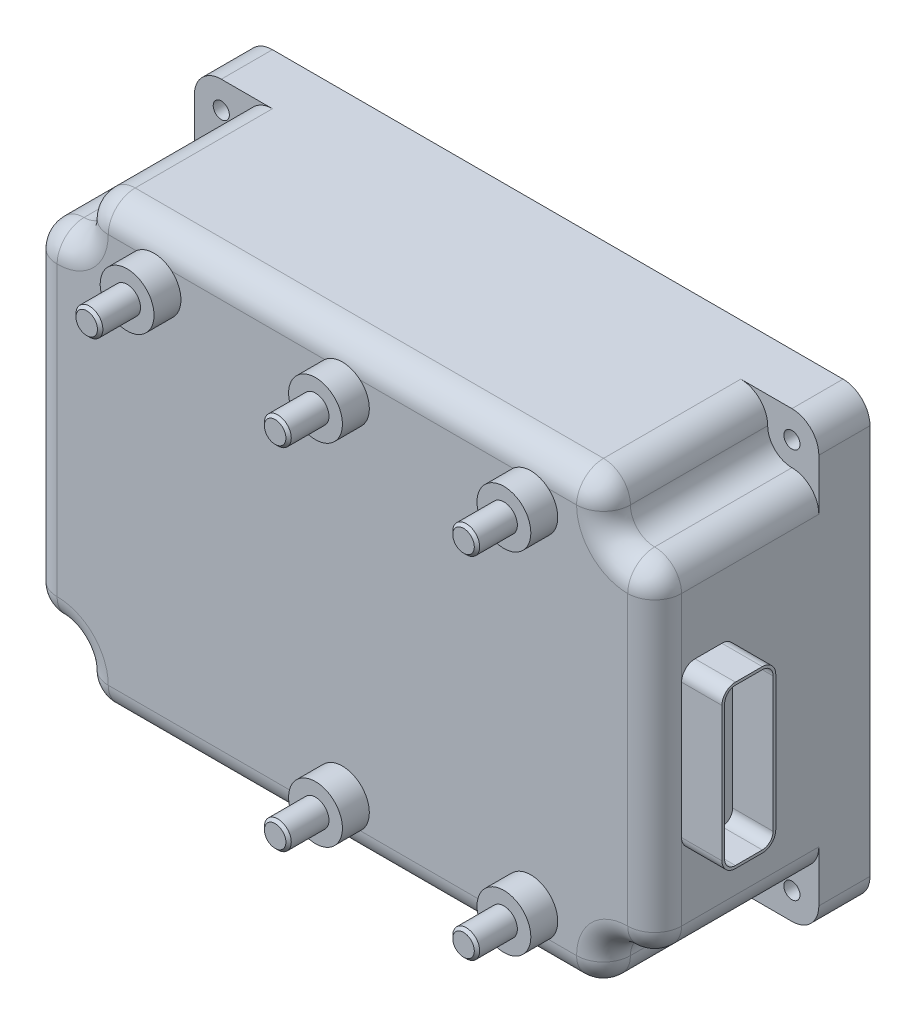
ISO-10303-21;
HEADER;
FILE_DESCRIPTION(('STEP AP214'),'2;1');
FILE_NAME('part.step','',(''),(''),'','','');
FILE_SCHEMA(('AUTOMOTIVE_DESIGN { 1 0 10303 214 1 1 1 1 }'));
ENDSEC;
DATA;
#1=APPLICATION_CONTEXT('core data for automotive mechanical design processes');
#2=APPLICATION_PROTOCOL_DEFINITION('international standard','automotive_design',2000,#1);
#3=PRODUCT_CONTEXT('',#1,'mechanical');
#4=PRODUCT('Part','Part','',(#3));
#5=PRODUCT_RELATED_PRODUCT_CATEGORY('part','',(#4));
#6=PRODUCT_DEFINITION_FORMATION('','',#4);
#7=PRODUCT_DEFINITION_CONTEXT('part definition',#1,'design');
#8=PRODUCT_DEFINITION('design','',#6,#7);
#9=PRODUCT_DEFINITION_SHAPE('','',#8);
#10=(LENGTH_UNIT() NAMED_UNIT(*) SI_UNIT(.MILLI.,.METRE.));
#11=(NAMED_UNIT(*) PLANE_ANGLE_UNIT() SI_UNIT($,.RADIAN.));
#12=(NAMED_UNIT(*) SI_UNIT($,.STERADIAN.) SOLID_ANGLE_UNIT());
#13=UNCERTAINTY_MEASURE_WITH_UNIT(LENGTH_MEASURE(1.E-05),#10,'distance_accuracy_value','');
#14=(GEOMETRIC_REPRESENTATION_CONTEXT(3) GLOBAL_UNCERTAINTY_ASSIGNED_CONTEXT((#13)) GLOBAL_UNIT_ASSIGNED_CONTEXT((#10,
#11,#12)) REPRESENTATION_CONTEXT('',''));
#15=CARTESIAN_POINT('',(0.,0.,0.));
#16=DIRECTION('',(0.,0.,1.));
#17=DIRECTION('',(1.,0.,0.));
#18=AXIS2_PLACEMENT_3D('',#15,#16,#17);
#19=CARTESIAN_POINT('',(116.,72.4999999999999,19.));
#20=DIRECTION('',(-1.,0.,0.));
#21=DIRECTION('',(0.,-1.,0.));
#22=AXIS2_PLACEMENT_3D('',#19,#20,#21);
#23=PLANE('',#22);
#24=CARTESIAN_POINT('',(116.,-25.,65.));
#25=DIRECTION('',(1.,0.,0.));
#26=DIRECTION('',(0.,-1.,0.));
#27=AXIS2_PLACEMENT_3D('',#24,#25,#26);
#28=CIRCLE('',#27,5.);
#29=CARTESIAN_POINT('',(116.,-24.9999999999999,70.));
#30=VERTEX_POINT('',#29);
#31=CARTESIAN_POINT('',(116.,-30.,65.));
#32=VERTEX_POINT('',#31);
#33=EDGE_CURVE('E361',#30,#32,#28,.T.);
#34=ORIENTED_EDGE('',*,*,#33,.F.);
#35=DIRECTION('',(0.,1.,0.));
#36=VECTOR('',#35,1.);
#37=CARTESIAN_POINT('',(116.,-53.5,70.));
#38=LINE('',#37,#36);
#39=CARTESIAN_POINT('',(116.,-53.5,70.));
#40=VERTEX_POINT('',#39);
#41=EDGE_CURVE('E728',#30,#40,#38,.F.);
#42=ORIENTED_EDGE('',*,*,#41,.T.);
#43=DIRECTION('',(0.,0.,-1.));
#44=VECTOR('',#43,1.);
#45=CARTESIAN_POINT('',(116.,-53.5,80.));
#46=LINE('',#45,#44);
#47=CARTESIAN_POINT('',(116.,-53.5,19.));
#48=VERTEX_POINT('',#47);
#49=EDGE_CURVE('E772',#40,#48,#46,.T.);
#50=ORIENTED_EDGE('',*,*,#49,.T.);
#51=DIRECTION('',(0.,1.,0.));
#52=VECTOR('',#51,1.);
#53=CARTESIAN_POINT('',(116.,72.4999999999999,19.));
#54=LINE('',#53,#52);
#55=CARTESIAN_POINT('',(116.,-72.4999999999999,19.));
#56=VERTEX_POINT('',#55);
#57=EDGE_CURVE('E843',#56,#48,#54,.T.);
#58=ORIENTED_EDGE('',*,*,#57,.F.);
#59=DIRECTION('',(0.,0.,-1.));
#60=VECTOR('',#59,1.);
#61=CARTESIAN_POINT('',(116.,-72.4999999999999,19.));
#62=LINE('',#61,#60);
#63=CARTESIAN_POINT('',(116.,-72.4999999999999,0.));
#64=VERTEX_POINT('',#63);
#65=EDGE_CURVE('E874',#56,#64,#62,.T.);
#66=ORIENTED_EDGE('',*,*,#65,.T.);
#67=DIRECTION('',(0.,1.,0.));
#68=VECTOR('',#67,1.);
#69=CARTESIAN_POINT('',(116.,72.4999999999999,0.));
#70=LINE('',#69,#68);
#71=CARTESIAN_POINT('',(116.,72.4999999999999,0.));
#72=VERTEX_POINT('',#71);
#73=EDGE_CURVE('E899',#64,#72,#70,.T.);
#74=ORIENTED_EDGE('',*,*,#73,.T.);
#75=DIRECTION('',(0.,0.,-1.));
#76=VECTOR('',#75,1.);
#77=CARTESIAN_POINT('',(116.,72.4999999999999,19.));
#78=LINE('',#77,#76);
#79=CARTESIAN_POINT('',(116.,72.4999999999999,19.));
#80=VERTEX_POINT('',#79);
#81=EDGE_CURVE('E871',#80,#72,#78,.T.);
#82=ORIENTED_EDGE('',*,*,#81,.F.);
#83=CARTESIAN_POINT('',(116.,53.5,19.));
#84=VERTEX_POINT('',#83);
#85=EDGE_CURVE('E850',#84,#80,#54,.T.);
#86=ORIENTED_EDGE('',*,*,#85,.F.);
#87=DIRECTION('',(0.,0.,-1.));
#88=VECTOR('',#87,1.);
#89=CARTESIAN_POINT('',(116.,53.5,80.));
#90=LINE('',#89,#88);
#91=CARTESIAN_POINT('',(116.,53.5,70.));
#92=VERTEX_POINT('',#91);
#93=EDGE_CURVE('E740',#92,#84,#90,.T.);
#94=ORIENTED_EDGE('',*,*,#93,.F.);
#95=CARTESIAN_POINT('',(116.,25.,70.));
#96=VERTEX_POINT('',#95);
#97=EDGE_CURVE('E737',#92,#96,#38,.F.);
#98=ORIENTED_EDGE('',*,*,#97,.T.);
#99=CARTESIAN_POINT('',(116.,25.,65.));
#100=DIRECTION('',(1.,0.,0.));
#101=DIRECTION('',(0.,-1.,0.));
#102=AXIS2_PLACEMENT_3D('',#99,#100,#101);
#103=CIRCLE('',#102,5.);
#104=CARTESIAN_POINT('',(116.,30.,65.));
#105=VERTEX_POINT('',#104);
#106=EDGE_CURVE('E424',#105,#96,#103,.T.);
#107=ORIENTED_EDGE('',*,*,#106,.F.);
#108=DIRECTION('',(0.,0.,1.));
#109=VECTOR('',#108,1.);
#110=CARTESIAN_POINT('',(116.,30.,65.));
#111=LINE('',#110,#109);
#112=CARTESIAN_POINT('',(116.,30.,55.));
#113=VERTEX_POINT('',#112);
#114=EDGE_CURVE('E421',#113,#105,#111,.T.);
#115=ORIENTED_EDGE('',*,*,#114,.F.);
#116=CARTESIAN_POINT('',(116.,25.,55.));
#117=DIRECTION('',(1.,0.,0.));
#118=DIRECTION('',(0.,-1.,0.));
#119=AXIS2_PLACEMENT_3D('',#116,#117,#118);
#120=CIRCLE('',#119,5.);
#121=CARTESIAN_POINT('',(116.,25.,50.));
#122=VERTEX_POINT('',#121);
#123=EDGE_CURVE('E418',#122,#113,#120,.T.);
#124=ORIENTED_EDGE('',*,*,#123,.F.);
#125=DIRECTION('',(0.,1.,0.));
#126=VECTOR('',#125,1.);
#127=CARTESIAN_POINT('',(116.,-24.9999999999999,50.));
#128=LINE('',#127,#126);
#129=CARTESIAN_POINT('',(116.,-24.9999999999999,50.));
#130=VERTEX_POINT('',#129);
#131=EDGE_CURVE('E415',#130,#122,#128,.T.);
#132=ORIENTED_EDGE('',*,*,#131,.F.);
#133=CARTESIAN_POINT('',(116.,-25.,55.));
#134=DIRECTION('',(1.,0.,0.));
#135=DIRECTION('',(0.,-1.,0.));
#136=AXIS2_PLACEMENT_3D('',#133,#134,#135);
#137=CIRCLE('',#136,5.);
#138=CARTESIAN_POINT('',(116.,-30.,55.));
#139=VERTEX_POINT('',#138);
#140=EDGE_CURVE('E50',#139,#130,#137,.T.);
#141=ORIENTED_EDGE('',*,*,#140,.F.);
#142=DIRECTION('',(0.,0.,-1.));
#143=VECTOR('',#142,1.);
#144=CARTESIAN_POINT('',(116.,-30.,65.));
#145=LINE('',#144,#143);
#146=EDGE_CURVE('E45',#32,#139,#145,.T.);
#147=ORIENTED_EDGE('',*,*,#146,.F.);
#148=EDGE_LOOP('',(#34,#42,#50,#58,#66,#74,#82,#86,#94,#98,#107,#115,#124,#132,#141,#147));
#149=FACE_BOUND('',#148,.T.);
#150=ADVANCED_FACE('F30',(#149),#23,.F.);
#151=CARTESIAN_POINT('',(0.,-65.,90.));
#152=DIRECTION('',(0.,0.,1.));
#153=DIRECTION('',(1.,0.,0.));
#154=AXIS2_PLACEMENT_3D('',#151,#152,#153);
#155=PLANE('',#154);
#156=CARTESIAN_POINT('',(0.,-65.,90.));
#157=DIRECTION('',(0.,0.,1.));
#158=DIRECTION('',(1.,0.,0.));
#159=AXIS2_PLACEMENT_3D('',#156,#157,#158);
#160=CIRCLE('',#159,10.);
#161=CARTESIAN_POINT('',(10.,-65.,90.));
#162=VERTEX_POINT('',#161);
#163=EDGE_CURVE('E489',#162,#162,#160,.T.);
#164=ORIENTED_EDGE('',*,*,#163,.T.);
#165=EDGE_LOOP('',(#164));
#166=FACE_BOUND('',#165,.T.);
#167=CARTESIAN_POINT('',(0.,-65.,90.));
#168=DIRECTION('',(0.,0.,1.));
#169=DIRECTION('',(1.,0.,0.));
#170=AXIS2_PLACEMENT_3D('',#167,#168,#169);
#171=CIRCLE('',#170,5.);
#172=CARTESIAN_POINT('',(5.,-65.,90.));
#173=VERTEX_POINT('',#172);
#174=EDGE_CURVE('E470',#173,#173,#171,.T.);
#175=ORIENTED_EDGE('',*,*,#174,.F.);
#176=EDGE_LOOP('',(#175));
#177=FACE_BOUND('',#176,.T.);
#178=ADVANCED_FACE('F650',(#166,#177),#155,.T.);
#179=CARTESIAN_POINT('',(70.,-65.,90.));
#180=DIRECTION('',(0.,0.,1.));
#181=DIRECTION('',(1.,0.,0.));
#182=AXIS2_PLACEMENT_3D('',#179,#180,#181);
#183=PLANE('',#182);
#184=CARTESIAN_POINT('',(70.,-65.,90.));
#185=DIRECTION('',(0.,0.,1.));
#186=DIRECTION('',(1.,0.,0.));
#187=AXIS2_PLACEMENT_3D('',#184,#185,#186);
#188=CIRCLE('',#187,9.99999999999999);
#189=CARTESIAN_POINT('',(80.,-65.,90.));
#190=VERTEX_POINT('',#189);
#191=EDGE_CURVE('E496',#190,#190,#188,.T.);
#192=ORIENTED_EDGE('',*,*,#191,.T.);
#193=EDGE_LOOP('',(#192));
#194=FACE_BOUND('',#193,.T.);
#195=CARTESIAN_POINT('',(70.,-65.,90.));
#196=DIRECTION('',(0.,0.,1.));
#197=DIRECTION('',(1.,0.,0.));
#198=AXIS2_PLACEMENT_3D('',#195,#196,#197);
#199=CIRCLE('',#198,5.00000000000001);
#200=CARTESIAN_POINT('',(75.,-65.,90.));
#201=VERTEX_POINT('',#200);
#202=EDGE_CURVE('E473',#201,#201,#199,.T.);
#203=ORIENTED_EDGE('',*,*,#202,.F.);
#204=EDGE_LOOP('',(#203));
#205=FACE_BOUND('',#204,.T.);
#206=ADVANCED_FACE('F655',(#194,#205),#183,.T.);
#207=CARTESIAN_POINT('',(70.,65.,90.));
#208=DIRECTION('',(0.,0.,1.));
#209=DIRECTION('',(1.,0.,0.));
#210=AXIS2_PLACEMENT_3D('',#207,#208,#209);
#211=PLANE('',#210);
#212=CARTESIAN_POINT('',(70.,65.,90.));
#213=DIRECTION('',(0.,0.,1.));
#214=DIRECTION('',(1.,0.,0.));
#215=AXIS2_PLACEMENT_3D('',#212,#213,#214);
#216=CIRCLE('',#215,9.99999999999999);
#217=CARTESIAN_POINT('',(80.,65.,90.));
#218=VERTEX_POINT('',#217);
#219=EDGE_CURVE('E503',#218,#218,#216,.T.);
#220=ORIENTED_EDGE('',*,*,#219,.T.);
#221=EDGE_LOOP('',(#220));
#222=FACE_BOUND('',#221,.T.);
#223=CARTESIAN_POINT('',(70.,65.,90.));
#224=DIRECTION('',(0.,0.,1.));
#225=DIRECTION('',(1.,0.,0.));
#226=AXIS2_PLACEMENT_3D('',#223,#224,#225);
#227=CIRCLE('',#226,5.00000000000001);
#228=CARTESIAN_POINT('',(75.,65.,90.));
#229=VERTEX_POINT('',#228);
#230=EDGE_CURVE('E476',#229,#229,#227,.T.);
#231=ORIENTED_EDGE('',*,*,#230,.F.);
#232=EDGE_LOOP('',(#231));
#233=FACE_BOUND('',#232,.T.);
#234=ADVANCED_FACE('F1044',(#222,#233),#211,.T.);
#235=CARTESIAN_POINT('',(0.,65.,90.));
#236=DIRECTION('',(0.,0.,1.));
#237=DIRECTION('',(1.,0.,0.));
#238=AXIS2_PLACEMENT_3D('',#235,#236,#237);
#239=PLANE('',#238);
#240=CARTESIAN_POINT('',(0.,65.,90.));
#241=DIRECTION('',(0.,0.,1.));
#242=DIRECTION('',(1.,0.,0.));
#243=AXIS2_PLACEMENT_3D('',#240,#241,#242);
#244=CIRCLE('',#243,10.);
#245=CARTESIAN_POINT('',(10.,65.,90.));
#246=VERTEX_POINT('',#245);
#247=EDGE_CURVE('E510',#246,#246,#244,.T.);
#248=ORIENTED_EDGE('',*,*,#247,.T.);
#249=EDGE_LOOP('',(#248));
#250=FACE_BOUND('',#249,.T.);
#251=CARTESIAN_POINT('',(0.,65.,90.));
#252=DIRECTION('',(0.,0.,1.));
#253=DIRECTION('',(1.,0.,0.));
#254=AXIS2_PLACEMENT_3D('',#251,#252,#253);
#255=CIRCLE('',#254,5.);
#256=CARTESIAN_POINT('',(5.,65.,90.));
#257=VERTEX_POINT('',#256);
#258=EDGE_CURVE('E479',#257,#257,#255,.T.);
#259=ORIENTED_EDGE('',*,*,#258,.F.);
#260=EDGE_LOOP('',(#259));
#261=FACE_BOUND('',#260,.T.);
#262=ADVANCED_FACE('F1048',(#250,#261),#239,.T.);
#263=CARTESIAN_POINT('',(-70.,65.,90.));
#264=DIRECTION('',(0.,0.,1.));
#265=DIRECTION('',(1.,0.,0.));
#266=AXIS2_PLACEMENT_3D('',#263,#264,#265);
#267=PLANE('',#266);
#268=CARTESIAN_POINT('',(-70.,65.,90.));
#269=DIRECTION('',(0.,0.,1.));
#270=DIRECTION('',(1.,0.,0.));
#271=AXIS2_PLACEMENT_3D('',#268,#269,#270);
#272=CIRCLE('',#271,10.);
#273=CARTESIAN_POINT('',(-60.,65.,90.));
#274=VERTEX_POINT('',#273);
#275=EDGE_CURVE('E517',#274,#274,#272,.T.);
#276=ORIENTED_EDGE('',*,*,#275,.T.);
#277=EDGE_LOOP('',(#276));
#278=FACE_BOUND('',#277,.T.);
#279=CARTESIAN_POINT('',(-70.,65.,90.));
#280=DIRECTION('',(0.,0.,1.));
#281=DIRECTION('',(1.,0.,0.));
#282=AXIS2_PLACEMENT_3D('',#279,#280,#281);
#283=CIRCLE('',#282,5.00000000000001);
#284=CARTESIAN_POINT('',(-65.,65.,90.));
#285=VERTEX_POINT('',#284);
#286=EDGE_CURVE('E482',#285,#285,#283,.T.);
#287=ORIENTED_EDGE('',*,*,#286,.F.);
#288=EDGE_LOOP('',(#287));
#289=FACE_BOUND('',#288,.T.);
#290=ADVANCED_FACE('F1051',(#278,#289),#267,.T.);
#291=CARTESIAN_POINT('',(-87.,72.5,80.));
#292=DIRECTION('',(0.,0.,1.));
#293=DIRECTION('',(1.,0.,0.));
#294=AXIS2_PLACEMENT_3D('',#291,#292,#293);
#295=PLANE('',#294);
#296=DIRECTION('',(1.,0.,0.));
#297=VECTOR('',#296,1.);
#298=CARTESIAN_POINT('',(87.,-72.5,80.));
#299=LINE('',#298,#297);
#300=CARTESIAN_POINT('',(-87.,-72.5,80.));
#301=VERTEX_POINT('',#300);
#302=CARTESIAN_POINT('',(-6.61437827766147,-72.5,80.));
#303=VERTEX_POINT('',#302);
#304=EDGE_CURVE('E1238',#301,#303,#299,.T.);
#305=ORIENTED_EDGE('',*,*,#304,.T.);
#306=CARTESIAN_POINT('',(0.,-65.,80.));
#307=DIRECTION('',(0.,0.,1.));
#308=DIRECTION('',(1.,0.,0.));
#309=AXIS2_PLACEMENT_3D('',#306,#307,#308);
#310=CIRCLE('',#309,10.);
#311=CARTESIAN_POINT('',(6.61437827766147,-72.5,80.));
#312=VERTEX_POINT('',#311);
#313=EDGE_CURVE('E485',#312,#303,#310,.T.);
#314=ORIENTED_EDGE('',*,*,#313,.F.);
#315=CARTESIAN_POINT('',(63.3856217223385,-72.5,80.));
#316=VERTEX_POINT('',#315);
#317=EDGE_CURVE('E1241',#312,#316,#299,.T.);
#318=ORIENTED_EDGE('',*,*,#317,.T.);
#319=CARTESIAN_POINT('',(70.,-65.,80.));
#320=DIRECTION('',(0.,0.,1.));
#321=DIRECTION('',(1.,0.,0.));
#322=AXIS2_PLACEMENT_3D('',#319,#320,#321);
#323=CIRCLE('',#322,9.99999999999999);
#324=CARTESIAN_POINT('',(76.6143782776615,-72.5,80.));
#325=VERTEX_POINT('',#324);
#326=EDGE_CURVE('E492',#325,#316,#323,.T.);
#327=ORIENTED_EDGE('',*,*,#326,.F.);
#328=CARTESIAN_POINT('',(87.,-72.5,80.));
#329=VERTEX_POINT('',#328);
#330=EDGE_CURVE('E1236',#325,#329,#299,.T.);
#331=ORIENTED_EDGE('',*,*,#330,.T.);
#332=CARTESIAN_POINT('',(106.,-72.5,80.));
#333=DIRECTION('',(0.,0.,1.));
#334=DIRECTION('',(1.,0.,0.));
#335=AXIS2_PLACEMENT_3D('',#332,#333,#334);
#336=CIRCLE('',#335,19.);
#337=CARTESIAN_POINT('',(106.,-53.5,80.));
#338=VERTEX_POINT('',#337);
#339=EDGE_CURVE('E996',#329,#338,#336,.F.);
#340=ORIENTED_EDGE('',*,*,#339,.T.);
#341=DIRECTION('',(0.,1.,0.));
#342=VECTOR('',#341,1.);
#343=CARTESIAN_POINT('',(106.,53.5,80.));
#344=LINE('',#343,#342);
#345=CARTESIAN_POINT('',(106.,53.5,80.));
#346=VERTEX_POINT('',#345);
#347=EDGE_CURVE('E992',#338,#346,#344,.T.);
#348=ORIENTED_EDGE('',*,*,#347,.T.);
#349=CARTESIAN_POINT('',(106.,72.5,80.));
#350=DIRECTION('',(0.,0.,1.));
#351=DIRECTION('',(1.,0.,0.));
#352=AXIS2_PLACEMENT_3D('',#349,#350,#351);
#353=CIRCLE('',#352,19.);
#354=CARTESIAN_POINT('',(87.,72.5,80.));
#355=VERTEX_POINT('',#354);
#356=EDGE_CURVE('E987',#346,#355,#353,.F.);
#357=ORIENTED_EDGE('',*,*,#356,.T.);
#358=DIRECTION('',(-1.,0.,0.));
#359=VECTOR('',#358,1.);
#360=CARTESIAN_POINT('',(-87.,72.5,80.));
#361=LINE('',#360,#359);
#362=CARTESIAN_POINT('',(76.6143782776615,72.5,80.));
#363=VERTEX_POINT('',#362);
#364=EDGE_CURVE('E969',#355,#363,#361,.T.);
#365=ORIENTED_EDGE('',*,*,#364,.T.);
#366=CARTESIAN_POINT('',(70.,65.,80.));
#367=DIRECTION('',(0.,0.,1.));
#368=DIRECTION('',(1.,0.,0.));
#369=AXIS2_PLACEMENT_3D('',#366,#367,#368);
#370=CIRCLE('',#369,9.99999999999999);
#371=CARTESIAN_POINT('',(63.3856217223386,72.5,80.));
#372=VERTEX_POINT('',#371);
#373=EDGE_CURVE('E499',#372,#363,#370,.T.);
#374=ORIENTED_EDGE('',*,*,#373,.F.);
#375=CARTESIAN_POINT('',(6.61437827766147,72.5,80.));
#376=VERTEX_POINT('',#375);
#377=EDGE_CURVE('E1000',#372,#376,#361,.T.);
#378=ORIENTED_EDGE('',*,*,#377,.T.);
#379=CARTESIAN_POINT('',(0.,65.,80.));
#380=DIRECTION('',(0.,0.,1.));
#381=DIRECTION('',(1.,0.,0.));
#382=AXIS2_PLACEMENT_3D('',#379,#380,#381);
#383=CIRCLE('',#382,10.);
#384=CARTESIAN_POINT('',(-6.61437827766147,72.5,80.));
#385=VERTEX_POINT('',#384);
#386=EDGE_CURVE('E506',#385,#376,#383,.T.);
#387=ORIENTED_EDGE('',*,*,#386,.F.);
#388=CARTESIAN_POINT('',(-63.3856217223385,72.5,80.));
#389=VERTEX_POINT('',#388);
#390=EDGE_CURVE('E1005',#385,#389,#361,.T.);
#391=ORIENTED_EDGE('',*,*,#390,.T.);
#392=CARTESIAN_POINT('',(-70.,65.,80.));
#393=DIRECTION('',(0.,0.,1.));
#394=DIRECTION('',(1.,0.,0.));
#395=AXIS2_PLACEMENT_3D('',#392,#393,#394);
#396=CIRCLE('',#395,10.);
#397=CARTESIAN_POINT('',(-76.6143782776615,72.5,80.));
#398=VERTEX_POINT('',#397);
#399=EDGE_CURVE('E513',#398,#389,#396,.T.);
#400=ORIENTED_EDGE('',*,*,#399,.F.);
#401=CARTESIAN_POINT('',(-87.,72.5,80.));
#402=VERTEX_POINT('',#401);
#403=EDGE_CURVE('E991',#398,#402,#361,.T.);
#404=ORIENTED_EDGE('',*,*,#403,.T.);
#405=CARTESIAN_POINT('',(-106.,72.5,80.));
#406=DIRECTION('',(0.,0.,1.));
#407=DIRECTION('',(1.,0.,0.));
#408=AXIS2_PLACEMENT_3D('',#405,#406,#407);
#409=CIRCLE('',#408,19.);
#410=CARTESIAN_POINT('',(-106.,53.5,80.));
#411=VERTEX_POINT('',#410);
#412=EDGE_CURVE('E585',#402,#411,#409,.F.);
#413=ORIENTED_EDGE('',*,*,#412,.T.);
#414=DIRECTION('',(0.,-1.,0.));
#415=VECTOR('',#414,1.);
#416=CARTESIAN_POINT('',(-106.,-53.5,80.));
#417=LINE('',#416,#415);
#418=CARTESIAN_POINT('',(-106.,-53.5,80.));
#419=VERTEX_POINT('',#418);
#420=EDGE_CURVE('E1245',#411,#419,#417,.T.);
#421=ORIENTED_EDGE('',*,*,#420,.T.);
#422=CARTESIAN_POINT('',(-106.,-72.5,80.));
#423=DIRECTION('',(0.,0.,1.));
#424=DIRECTION('',(1.,0.,0.));
#425=AXIS2_PLACEMENT_3D('',#422,#423,#424);
#426=CIRCLE('',#425,19.);
#427=EDGE_CURVE('E1244',#419,#301,#426,.F.);
#428=ORIENTED_EDGE('',*,*,#427,.T.);
#429=EDGE_LOOP('',(#305,#314,#318,#327,#331,#340,#348,#357,#365,#374,#378,#387,#391,#400,#404,
#413,#421,#428));
#430=FACE_BOUND('',#429,.T.);
#431=ADVANCED_FACE('F1022',(#430),#295,.T.);
#432=CARTESIAN_POINT('',(-106.,72.5,19.));
#433=DIRECTION('',(0.,0.,-1.));
#434=DIRECTION('',(-1.,0.,0.));
#435=AXIS2_PLACEMENT_3D('',#432,#433,#434);
#436=PLANE('',#435);
#437=CARTESIAN_POINT('',(106.,72.5,19.));
#438=DIRECTION('',(0.,0.,1.));
#439=DIRECTION('',(1.,0.,0.));
#440=AXIS2_PLACEMENT_3D('',#437,#438,#439);
#441=CIRCLE('',#440,3.00000000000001);
#442=CARTESIAN_POINT('',(109.,72.5,19.));
#443=VERTEX_POINT('',#442);
#444=EDGE_CURVE('E930',#443,#443,#441,.T.);
#445=ORIENTED_EDGE('',*,*,#444,.F.);
#446=EDGE_LOOP('',(#445));
#447=FACE_BOUND('',#446,.T.);
#448=CARTESIAN_POINT('',(87.,72.5,19.));
#449=DIRECTION('',(0.,0.,1.));
#450=DIRECTION('',(-1.,0.,0.));
#451=AXIS2_PLACEMENT_3D('',#448,#449,#450);
#452=CIRCLE('',#451,9.99999999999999);
#453=CARTESIAN_POINT('',(97.,72.5,19.));
#454=VERTEX_POINT('',#453);
#455=CARTESIAN_POINT('',(87.,82.5,19.));
#456=VERTEX_POINT('',#455);
#457=EDGE_CURVE('E952',#454,#456,#452,.T.);
#458=ORIENTED_EDGE('',*,*,#457,.F.);
#459=CARTESIAN_POINT('',(106.,72.5,19.));
#460=DIRECTION('',(0.,0.,-1.));
#461=DIRECTION('',(1.,0.,0.));
#462=AXIS2_PLACEMENT_3D('',#459,#460,#461);
#463=CIRCLE('',#462,8.99999999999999);
#464=CARTESIAN_POINT('',(106.,63.5,19.));
#465=VERTEX_POINT('',#464);
#466=EDGE_CURVE('E803',#465,#454,#463,.T.);
#467=ORIENTED_EDGE('',*,*,#466,.F.);
#468=CARTESIAN_POINT('',(106.,53.5,19.));
#469=DIRECTION('',(0.,0.,1.));
#470=DIRECTION('',(1.,0.,0.));
#471=AXIS2_PLACEMENT_3D('',#468,#469,#470);
#472=CIRCLE('',#471,10.);
#473=EDGE_CURVE('E808',#84,#465,#472,.T.);
#474=ORIENTED_EDGE('',*,*,#473,.F.);
#475=ORIENTED_EDGE('',*,*,#85,.T.);
#476=CARTESIAN_POINT('',(106.,72.5,19.));
#477=DIRECTION('',(0.,0.,1.));
#478=DIRECTION('',(-1.,0.,0.));
#479=AXIS2_PLACEMENT_3D('',#476,#477,#478);
#480=CIRCLE('',#479,9.99999999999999);
#481=CARTESIAN_POINT('',(106.,82.5,19.));
#482=VERTEX_POINT('',#481);
#483=EDGE_CURVE('E853',#80,#482,#480,.T.);
#484=ORIENTED_EDGE('',*,*,#483,.T.);
#485=DIRECTION('',(-1.,0.,0.));
#486=VECTOR('',#485,1.);
#487=CARTESIAN_POINT('',(-106.,82.5,19.));
#488=LINE('',#487,#486);
#489=EDGE_CURVE('E857',#482,#456,#488,.T.);
#490=ORIENTED_EDGE('',*,*,#489,.T.);
#491=EDGE_LOOP('',(#458,#467,#474,#475,#484,#490));
#492=FACE_BOUND('',#491,.T.);
#493=ADVANCED_FACE('F1124',(#447,#492),#436,.F.);
#494=CARTESIAN_POINT('',(106.,-72.5,19.));
#495=DIRECTION('',(0.,0.,1.));
#496=DIRECTION('',(1.,0.,0.));
#497=AXIS2_PLACEMENT_3D('',#494,#495,#496);
#498=CIRCLE('',#497,3.00000000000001);
#499=CARTESIAN_POINT('',(109.,-72.5,19.));
#500=VERTEX_POINT('',#499);
#501=EDGE_CURVE('E924',#500,#500,#498,.T.);
#502=ORIENTED_EDGE('',*,*,#501,.F.);
#503=EDGE_LOOP('',(#502));
#504=FACE_BOUND('',#503,.T.);
#505=CARTESIAN_POINT('',(106.,-53.5,19.));
#506=DIRECTION('',(0.,0.,1.));
#507=DIRECTION('',(-1.,0.,0.));
#508=AXIS2_PLACEMENT_3D('',#505,#506,#507);
#509=CIRCLE('',#508,9.99999999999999);
#510=CARTESIAN_POINT('',(106.,-63.5,19.));
#511=VERTEX_POINT('',#510);
#512=EDGE_CURVE('E800',#511,#48,#509,.T.);
#513=ORIENTED_EDGE('',*,*,#512,.F.);
#514=CARTESIAN_POINT('',(106.,-72.5,19.));
#515=DIRECTION('',(0.,0.,-1.));
#516=DIRECTION('',(1.,0.,0.));
#517=AXIS2_PLACEMENT_3D('',#514,#515,#516);
#518=CIRCLE('',#517,8.99999999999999);
#519=CARTESIAN_POINT('',(97.,-72.5,19.));
#520=VERTEX_POINT('',#519);
#521=EDGE_CURVE('E797',#520,#511,#518,.T.);
#522=ORIENTED_EDGE('',*,*,#521,.F.);
#523=CARTESIAN_POINT('',(87.,-72.5,19.));
#524=DIRECTION('',(0.,0.,1.));
#525=DIRECTION('',(1.,0.,0.));
#526=AXIS2_PLACEMENT_3D('',#523,#524,#525);
#527=CIRCLE('',#526,9.99999999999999);
#528=CARTESIAN_POINT('',(87.,-82.5,19.));
#529=VERTEX_POINT('',#528);
#530=EDGE_CURVE('E792',#529,#520,#527,.T.);
#531=ORIENTED_EDGE('',*,*,#530,.F.);
#532=DIRECTION('',(1.,0.,0.));
#533=VECTOR('',#532,1.);
#534=CARTESIAN_POINT('',(-106.,-82.5,19.));
#535=LINE('',#534,#533);
#536=CARTESIAN_POINT('',(106.,-82.5,19.));
#537=VERTEX_POINT('',#536);
#538=EDGE_CURVE('E824',#529,#537,#535,.T.);
#539=ORIENTED_EDGE('',*,*,#538,.T.);
#540=CARTESIAN_POINT('',(106.,-72.5,19.));
#541=DIRECTION('',(0.,0.,1.));
#542=DIRECTION('',(-1.,0.,0.));
#543=AXIS2_PLACEMENT_3D('',#540,#541,#542);
#544=CIRCLE('',#543,10.);
#545=EDGE_CURVE('E836',#537,#56,#544,.T.);
#546=ORIENTED_EDGE('',*,*,#545,.T.);
#547=ORIENTED_EDGE('',*,*,#57,.T.);
#548=EDGE_LOOP('',(#513,#522,#531,#539,#546,#547));
#549=FACE_BOUND('',#548,.T.);
#550=ADVANCED_FACE('F823',(#504,#549),#436,.F.);
#551=CARTESIAN_POINT('',(-106.,-72.5,19.));
#552=DIRECTION('',(0.,0.,1.));
#553=DIRECTION('',(1.,0.,0.));
#554=AXIS2_PLACEMENT_3D('',#551,#552,#553);
#555=CIRCLE('',#554,3.00000000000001);
#556=CARTESIAN_POINT('',(-103.,-72.5,19.));
#557=VERTEX_POINT('',#556);
#558=EDGE_CURVE('E918',#557,#557,#555,.T.);
#559=ORIENTED_EDGE('',*,*,#558,.F.);
#560=EDGE_LOOP('',(#559));
#561=FACE_BOUND('',#560,.T.);
#562=CARTESIAN_POINT('',(-87.,-72.5,19.));
#563=DIRECTION('',(0.,0.,1.));
#564=DIRECTION('',(-1.,0.,0.));
#565=AXIS2_PLACEMENT_3D('',#562,#563,#564);
#566=CIRCLE('',#565,10.);
#567=CARTESIAN_POINT('',(-97.,-72.5,19.));
#568=VERTEX_POINT('',#567);
#569=CARTESIAN_POINT('',(-87.,-82.5,19.));
#570=VERTEX_POINT('',#569);
#571=EDGE_CURVE('E789',#568,#570,#566,.T.);
#572=ORIENTED_EDGE('',*,*,#571,.F.);
#573=CARTESIAN_POINT('',(-106.,-72.5,19.));
#574=DIRECTION('',(0.,0.,-1.));
#575=DIRECTION('',(1.,0.,0.));
#576=AXIS2_PLACEMENT_3D('',#573,#574,#575);
#577=CIRCLE('',#576,9.00000000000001);
#578=CARTESIAN_POINT('',(-106.,-63.5,19.));
#579=VERTEX_POINT('',#578);
#580=EDGE_CURVE('E574',#579,#568,#577,.T.);
#581=ORIENTED_EDGE('',*,*,#580,.F.);
#582=CARTESIAN_POINT('',(-106.,-53.5,19.));
#583=DIRECTION('',(0.,0.,1.));
#584=DIRECTION('',(1.,0.,0.));
#585=AXIS2_PLACEMENT_3D('',#582,#583,#584);
#586=CIRCLE('',#585,9.99999999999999);
#587=CARTESIAN_POINT('',(-116.,-53.5,19.));
#588=VERTEX_POINT('',#587);
#589=EDGE_CURVE('E580',#588,#579,#586,.T.);
#590=ORIENTED_EDGE('',*,*,#589,.F.);
#591=DIRECTION('',(0.,-1.,0.));
#592=VECTOR('',#591,1.);
#593=CARTESIAN_POINT('',(-116.,72.4999999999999,19.));
#594=LINE('',#593,#592);
#595=CARTESIAN_POINT('',(-116.,-72.4999999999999,19.));
#596=VERTEX_POINT('',#595);
#597=EDGE_CURVE('E888',#588,#596,#594,.T.);
#598=ORIENTED_EDGE('',*,*,#597,.T.);
#599=CARTESIAN_POINT('',(-106.,-72.5,19.));
#600=DIRECTION('',(0.,0.,1.));
#601=DIRECTION('',(-1.,0.,0.));
#602=AXIS2_PLACEMENT_3D('',#599,#600,#601);
#603=CIRCLE('',#602,9.99999999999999);
#604=CARTESIAN_POINT('',(-106.,-82.5,19.));
#605=VERTEX_POINT('',#604);
#606=EDGE_CURVE('E833',#596,#605,#603,.T.);
#607=ORIENTED_EDGE('',*,*,#606,.T.);
#608=EDGE_CURVE('E832',#605,#570,#535,.T.);
#609=ORIENTED_EDGE('',*,*,#608,.T.);
#610=EDGE_LOOP('',(#572,#581,#590,#598,#607,#609));
#611=FACE_BOUND('',#610,.T.);
#612=ADVANCED_FACE('F1292',(#561,#611),#436,.F.);
#613=CARTESIAN_POINT('',(-106.,72.5,19.));
#614=DIRECTION('',(0.,0.,1.));
#615=DIRECTION('',(1.,0.,0.));
#616=AXIS2_PLACEMENT_3D('',#613,#614,#615);
#617=CIRCLE('',#616,3.00000000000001);
#618=CARTESIAN_POINT('',(-103.,72.5,19.));
#619=VERTEX_POINT('',#618);
#620=EDGE_CURVE('E912',#619,#619,#617,.T.);
#621=ORIENTED_EDGE('',*,*,#620,.F.);
#622=EDGE_LOOP('',(#621));
#623=FACE_BOUND('',#622,.T.);
#624=CARTESIAN_POINT('',(-87.,72.5,19.));
#625=DIRECTION('',(0.,0.,1.));
#626=DIRECTION('',(1.,0.,0.));
#627=AXIS2_PLACEMENT_3D('',#624,#625,#626);
#628=CIRCLE('',#627,10.);
#629=CARTESIAN_POINT('',(-87.,82.5,19.));
#630=VERTEX_POINT('',#629);
#631=CARTESIAN_POINT('',(-97.,72.5,19.));
#632=VERTEX_POINT('',#631);
#633=EDGE_CURVE('E567',#630,#632,#628,.T.);
#634=ORIENTED_EDGE('',*,*,#633,.F.);
#635=CARTESIAN_POINT('',(-106.,82.5,19.));
#636=VERTEX_POINT('',#635);
#637=EDGE_CURVE('E861',#630,#636,#488,.T.);
#638=ORIENTED_EDGE('',*,*,#637,.T.);
#639=CARTESIAN_POINT('',(-106.,72.5,19.));
#640=DIRECTION('',(0.,0.,1.));
#641=DIRECTION('',(-1.,0.,0.));
#642=AXIS2_PLACEMENT_3D('',#639,#640,#641);
#643=CIRCLE('',#642,9.99999999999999);
#644=CARTESIAN_POINT('',(-116.,72.4999999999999,19.));
#645=VERTEX_POINT('',#644);
#646=EDGE_CURVE('E891',#636,#645,#643,.T.);
#647=ORIENTED_EDGE('',*,*,#646,.T.);
#648=CARTESIAN_POINT('',(-116.,53.5,19.));
#649=VERTEX_POINT('',#648);
#650=EDGE_CURVE('E838',#645,#649,#594,.T.);
#651=ORIENTED_EDGE('',*,*,#650,.T.);
#652=CARTESIAN_POINT('',(-106.,53.5,19.));
#653=DIRECTION('',(0.,0.,1.));
#654=DIRECTION('',(-1.,0.,0.));
#655=AXIS2_PLACEMENT_3D('',#652,#653,#654);
#656=CIRCLE('',#655,10.);
#657=CARTESIAN_POINT('',(-106.,63.5,19.));
#658=VERTEX_POINT('',#657);
#659=EDGE_CURVE('E571',#658,#649,#656,.T.);
#660=ORIENTED_EDGE('',*,*,#659,.F.);
#661=CARTESIAN_POINT('',(-106.,72.5,19.));
#662=DIRECTION('',(0.,0.,-1.));
#663=DIRECTION('',(1.,0.,0.));
#664=AXIS2_PLACEMENT_3D('',#661,#662,#663);
#665=CIRCLE('',#664,9.00000000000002);
#666=EDGE_CURVE('E568',#632,#658,#665,.T.);
#667=ORIENTED_EDGE('',*,*,#666,.F.);
#668=EDGE_LOOP('',(#634,#638,#647,#651,#660,#667));
#669=FACE_BOUND('',#668,.T.);
#670=ADVANCED_FACE('F1188',(#623,#669),#436,.F.);
#671=CARTESIAN_POINT('',(-106.,72.5,0.));
#672=DIRECTION('',(0.,0.,-1.));
#673=DIRECTION('',(-1.,0.,0.));
#674=AXIS2_PLACEMENT_3D('',#671,#672,#673);
#675=PLANE('',#674);
#676=CARTESIAN_POINT('',(106.,-72.5,0.));
#677=DIRECTION('',(0.,0.,1.));
#678=DIRECTION('',(1.,0.,0.));
#679=AXIS2_PLACEMENT_3D('',#676,#677,#678);
#680=CIRCLE('',#679,3.00000000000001);
#681=CARTESIAN_POINT('',(109.,-72.5,0.));
#682=VERTEX_POINT('',#681);
#683=EDGE_CURVE('E927',#682,#682,#680,.T.);
#684=ORIENTED_EDGE('',*,*,#683,.T.);
#685=EDGE_LOOP('',(#684));
#686=FACE_BOUND('',#685,.T.);
#687=CARTESIAN_POINT('',(-106.,72.5,0.));
#688=DIRECTION('',(0.,0.,1.));
#689=DIRECTION('',(1.,0.,0.));
#690=AXIS2_PLACEMENT_3D('',#687,#688,#689);
#691=CIRCLE('',#690,3.00000000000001);
#692=CARTESIAN_POINT('',(-103.,72.5,0.));
#693=VERTEX_POINT('',#692);
#694=EDGE_CURVE('E915',#693,#693,#691,.T.);
#695=ORIENTED_EDGE('',*,*,#694,.T.);
#696=EDGE_LOOP('',(#695));
#697=FACE_BOUND('',#696,.T.);
#698=CARTESIAN_POINT('',(-106.,72.5,0.));
#699=DIRECTION('',(0.,0.,1.));
#700=DIRECTION('',(-1.,0.,0.));
#701=AXIS2_PLACEMENT_3D('',#698,#699,#700);
#702=CIRCLE('',#701,9.99999999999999);
#703=CARTESIAN_POINT('',(-106.,82.5,0.));
#704=VERTEX_POINT('',#703);
#705=CARTESIAN_POINT('',(-116.,72.4999999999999,0.));
#706=VERTEX_POINT('',#705);
#707=EDGE_CURVE('E909',#704,#706,#702,.T.);
#708=ORIENTED_EDGE('',*,*,#707,.F.);
#709=DIRECTION('',(-1.,0.,0.));
#710=VECTOR('',#709,1.);
#711=CARTESIAN_POINT('',(-106.,82.5,0.));
#712=LINE('',#711,#710);
#713=CARTESIAN_POINT('',(106.,82.5,0.));
#714=VERTEX_POINT('',#713);
#715=EDGE_CURVE('E895',#714,#704,#712,.T.);
#716=ORIENTED_EDGE('',*,*,#715,.F.);
#717=CARTESIAN_POINT('',(106.,72.5,0.));
#718=DIRECTION('',(0.,0.,1.));
#719=DIRECTION('',(-1.,0.,0.));
#720=AXIS2_PLACEMENT_3D('',#717,#718,#719);
#721=CIRCLE('',#720,9.99999999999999);
#722=EDGE_CURVE('E897',#72,#714,#721,.T.);
#723=ORIENTED_EDGE('',*,*,#722,.F.);
#724=ORIENTED_EDGE('',*,*,#73,.F.);
#725=CARTESIAN_POINT('',(106.,-72.5,0.));
#726=DIRECTION('',(0.,0.,1.));
#727=DIRECTION('',(-1.,0.,0.));
#728=AXIS2_PLACEMENT_3D('',#725,#726,#727);
#729=CIRCLE('',#728,10.);
#730=CARTESIAN_POINT('',(106.,-82.5,0.));
#731=VERTEX_POINT('',#730);
#732=EDGE_CURVE('E901',#731,#64,#729,.T.);
#733=ORIENTED_EDGE('',*,*,#732,.F.);
#734=DIRECTION('',(1.,0.,0.));
#735=VECTOR('',#734,1.);
#736=CARTESIAN_POINT('',(-106.,-82.5,0.));
#737=LINE('',#736,#735);
#738=CARTESIAN_POINT('',(-106.,-82.5,0.));
#739=VERTEX_POINT('',#738);
#740=EDGE_CURVE('E903',#739,#731,#737,.T.);
#741=ORIENTED_EDGE('',*,*,#740,.F.);
#742=CARTESIAN_POINT('',(-106.,-72.5,0.));
#743=DIRECTION('',(0.,0.,1.));
#744=DIRECTION('',(-1.,0.,0.));
#745=AXIS2_PLACEMENT_3D('',#742,#743,#744);
#746=CIRCLE('',#745,9.99999999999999);
#747=CARTESIAN_POINT('',(-116.,-72.4999999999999,0.));
#748=VERTEX_POINT('',#747);
#749=EDGE_CURVE('E905',#748,#739,#746,.T.);
#750=ORIENTED_EDGE('',*,*,#749,.F.);
#751=DIRECTION('',(0.,-1.,0.));
#752=VECTOR('',#751,1.);
#753=CARTESIAN_POINT('',(-116.,72.4999999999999,0.));
#754=LINE('',#753,#752);
#755=EDGE_CURVE('E907',#706,#748,#754,.T.);
#756=ORIENTED_EDGE('',*,*,#755,.F.);
#757=EDGE_LOOP('',(#708,#716,#723,#724,#733,#741,#750,#756));
#758=FACE_BOUND('',#757,.T.);
#759=CARTESIAN_POINT('',(-106.,-72.5,0.));
#760=DIRECTION('',(0.,0.,1.));
#761=DIRECTION('',(1.,0.,0.));
#762=AXIS2_PLACEMENT_3D('',#759,#760,#761);
#763=CIRCLE('',#762,3.00000000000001);
#764=CARTESIAN_POINT('',(-103.,-72.5,0.));
#765=VERTEX_POINT('',#764);
#766=EDGE_CURVE('E921',#765,#765,#763,.T.);
#767=ORIENTED_EDGE('',*,*,#766,.T.);
#768=EDGE_LOOP('',(#767));
#769=FACE_BOUND('',#768,.T.);
#770=CARTESIAN_POINT('',(106.,72.5,0.));
#771=DIRECTION('',(0.,0.,1.));
#772=DIRECTION('',(1.,0.,0.));
#773=AXIS2_PLACEMENT_3D('',#770,#771,#772);
#774=CIRCLE('',#773,3.00000000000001);
#775=CARTESIAN_POINT('',(109.,72.5,0.));
#776=VERTEX_POINT('',#775);
#777=EDGE_CURVE('E933',#776,#776,#774,.T.);
#778=ORIENTED_EDGE('',*,*,#777,.T.);
#779=EDGE_LOOP('',(#778));
#780=FACE_BOUND('',#779,.T.);
#781=ADVANCED_FACE('F1185',(#686,#697,#758,#769,#780),#675,.T.);
#782=CARTESIAN_POINT('',(-106.,72.5,19.));
#783=DIRECTION('',(0.,0.,-1.));
#784=DIRECTION('',(-1.,0.,0.));
#785=AXIS2_PLACEMENT_3D('',#782,#783,#784);
#786=CYLINDRICAL_SURFACE('',#785,9.99999999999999);
#787=ORIENTED_EDGE('',*,*,#707,.T.);
#788=DIRECTION('',(0.,0.,-1.));
#789=VECTOR('',#788,1.);
#790=CARTESIAN_POINT('',(-116.,72.4999999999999,19.));
#791=LINE('',#790,#789);
#792=EDGE_CURVE('E884',#645,#706,#791,.T.);
#793=ORIENTED_EDGE('',*,*,#792,.F.);
#794=ORIENTED_EDGE('',*,*,#646,.F.);
#795=DIRECTION('',(0.,0.,-1.));
#796=VECTOR('',#795,1.);
#797=CARTESIAN_POINT('',(-106.,82.5,19.));
#798=LINE('',#797,#796);
#799=EDGE_CURVE('E860',#636,#704,#798,.T.);
#800=ORIENTED_EDGE('',*,*,#799,.T.);
#801=EDGE_LOOP('',(#787,#793,#794,#800));
#802=FACE_BOUND('',#801,.T.);
#803=ADVANCED_FACE('F32',(#802),#786,.T.);
#804=CARTESIAN_POINT('',(-116.,72.4999999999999,19.));
#805=DIRECTION('',(1.,0.,0.));
#806=DIRECTION('',(0.,0.,-1.));
#807=AXIS2_PLACEMENT_3D('',#804,#805,#806);
#808=PLANE('',#807);
#809=DIRECTION('',(0.,0.,-1.));
#810=VECTOR('',#809,1.);
#811=CARTESIAN_POINT('',(-116.,-53.5,80.));
#812=LINE('',#811,#810);
#813=CARTESIAN_POINT('',(-116.,-53.5,70.));
#814=VERTEX_POINT('',#813);
#815=EDGE_CURVE('E592',#814,#588,#812,.T.);
#816=ORIENTED_EDGE('',*,*,#815,.F.);
#817=DIRECTION('',(0.,-1.,0.));
#818=VECTOR('',#817,1.);
#819=CARTESIAN_POINT('',(-116.,53.5,70.));
#820=LINE('',#819,#818);
#821=CARTESIAN_POINT('',(-116.,53.5,70.));
#822=VERTEX_POINT('',#821);
#823=EDGE_CURVE('E595',#814,#822,#820,.F.);
#824=ORIENTED_EDGE('',*,*,#823,.T.);
#825=DIRECTION('',(0.,0.,-1.));
#826=VECTOR('',#825,1.);
#827=CARTESIAN_POINT('',(-116.,53.5,80.));
#828=LINE('',#827,#826);
#829=EDGE_CURVE('E588',#822,#649,#828,.T.);
#830=ORIENTED_EDGE('',*,*,#829,.T.);
#831=ORIENTED_EDGE('',*,*,#650,.F.);
#832=ORIENTED_EDGE('',*,*,#792,.T.);
#833=ORIENTED_EDGE('',*,*,#755,.T.);
#834=DIRECTION('',(0.,0.,-1.));
#835=VECTOR('',#834,1.);
#836=CARTESIAN_POINT('',(-116.,-72.4999999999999,19.));
#837=LINE('',#836,#835);
#838=EDGE_CURVE('E881',#596,#748,#837,.T.);
#839=ORIENTED_EDGE('',*,*,#838,.F.);
#840=ORIENTED_EDGE('',*,*,#597,.F.);
#841=EDGE_LOOP('',(#816,#824,#830,#831,#832,#833,#839,#840));
#842=FACE_BOUND('',#841,.T.);
#843=ADVANCED_FACE('F1266',(#842),#808,.F.);
#844=CARTESIAN_POINT('',(-106.,-72.5,19.));
#845=DIRECTION('',(0.,0.,-1.));
#846=DIRECTION('',(-1.,0.,0.));
#847=AXIS2_PLACEMENT_3D('',#844,#845,#846);
#848=CYLINDRICAL_SURFACE('',#847,9.99999999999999);
#849=ORIENTED_EDGE('',*,*,#749,.T.);
#850=DIRECTION('',(0.,0.,-1.));
#851=VECTOR('',#850,1.);
#852=CARTESIAN_POINT('',(-106.,-82.5,19.));
#853=LINE('',#852,#851);
#854=EDGE_CURVE('E878',#605,#739,#853,.T.);
#855=ORIENTED_EDGE('',*,*,#854,.F.);
#856=ORIENTED_EDGE('',*,*,#606,.F.);
#857=ORIENTED_EDGE('',*,*,#838,.T.);
#858=EDGE_LOOP('',(#849,#855,#856,#857));
#859=FACE_BOUND('',#858,.T.);
#860=ADVANCED_FACE('F1300',(#859),#848,.T.);
#861=CARTESIAN_POINT('',(-106.,-82.5,19.));
#862=DIRECTION('',(0.,1.,0.));
#863=DIRECTION('',(0.,0.,1.));
#864=AXIS2_PLACEMENT_3D('',#861,#862,#863);
#865=PLANE('',#864);
#866=DIRECTION('',(0.,0.,-1.));
#867=VECTOR('',#866,1.);
#868=CARTESIAN_POINT('',(87.,-82.5,80.));
#869=LINE('',#868,#867);
#870=CARTESIAN_POINT('',(87.,-82.5,70.));
#871=VERTEX_POINT('',#870);
#872=EDGE_CURVE('E778',#871,#529,#869,.T.);
#873=ORIENTED_EDGE('',*,*,#872,.F.);
#874=DIRECTION('',(1.,0.,0.));
#875=VECTOR('',#874,1.);
#876=CARTESIAN_POINT('',(-87.,-82.5,70.));
#877=LINE('',#876,#875);
#878=CARTESIAN_POINT('',(-87.,-82.5,70.));
#879=VERTEX_POINT('',#878);
#880=EDGE_CURVE('E1285',#871,#879,#877,.F.);
#881=ORIENTED_EDGE('',*,*,#880,.T.);
#882=DIRECTION('',(0.,0.,-1.));
#883=VECTOR('',#882,1.);
#884=CARTESIAN_POINT('',(-87.,-82.5,80.));
#885=LINE('',#884,#883);
#886=EDGE_CURVE('E781',#879,#570,#885,.T.);
#887=ORIENTED_EDGE('',*,*,#886,.T.);
#888=ORIENTED_EDGE('',*,*,#608,.F.);
#889=ORIENTED_EDGE('',*,*,#854,.T.);
#890=ORIENTED_EDGE('',*,*,#740,.T.);
#891=DIRECTION('',(0.,0.,-1.));
#892=VECTOR('',#891,1.);
#893=CARTESIAN_POINT('',(106.,-82.5,19.));
#894=LINE('',#893,#892);
#895=EDGE_CURVE('E830',#537,#731,#894,.T.);
#896=ORIENTED_EDGE('',*,*,#895,.F.);
#897=ORIENTED_EDGE('',*,*,#538,.F.);
#898=EDGE_LOOP('',(#873,#881,#887,#888,#889,#890,#896,#897));
#899=FACE_BOUND('',#898,.T.);
#900=ADVANCED_FACE('F827',(#899),#865,.F.);
#901=CARTESIAN_POINT('',(106.,-72.5,19.));
#902=DIRECTION('',(0.,0.,-1.));
#903=DIRECTION('',(-1.,0.,0.));
#904=AXIS2_PLACEMENT_3D('',#901,#902,#903);
#905=CYLINDRICAL_SURFACE('',#904,10.);
#906=ORIENTED_EDGE('',*,*,#732,.T.);
#907=ORIENTED_EDGE('',*,*,#65,.F.);
#908=ORIENTED_EDGE('',*,*,#545,.F.);
#909=ORIENTED_EDGE('',*,*,#895,.T.);
#910=EDGE_LOOP('',(#906,#907,#908,#909));
#911=FACE_BOUND('',#910,.T.);
#912=ADVANCED_FACE('F1197',(#911),#905,.T.);
#913=CARTESIAN_POINT('',(106.,72.5,19.));
#914=DIRECTION('',(0.,0.,-1.));
#915=DIRECTION('',(-1.,0.,0.));
#916=AXIS2_PLACEMENT_3D('',#913,#914,#915);
#917=CYLINDRICAL_SURFACE('',#916,9.99999999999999);
#918=ORIENTED_EDGE('',*,*,#722,.T.);
#919=DIRECTION('',(0.,0.,-1.));
#920=VECTOR('',#919,1.);
#921=CARTESIAN_POINT('',(106.,82.5,19.));
#922=LINE('',#921,#920);
#923=EDGE_CURVE('E868',#482,#714,#922,.T.);
#924=ORIENTED_EDGE('',*,*,#923,.F.);
#925=ORIENTED_EDGE('',*,*,#483,.F.);
#926=ORIENTED_EDGE('',*,*,#81,.T.);
#927=EDGE_LOOP('',(#918,#924,#925,#926));
#928=FACE_BOUND('',#927,.T.);
#929=ADVANCED_FACE('F1194',(#928),#917,.T.);
#930=CARTESIAN_POINT('',(-106.,82.5,19.));
#931=DIRECTION('',(0.,-1.,0.));
#932=DIRECTION('',(0.,0.,-1.));
#933=AXIS2_PLACEMENT_3D('',#930,#931,#932);
#934=PLANE('',#933);
#935=DIRECTION('',(0.,0.,-1.));
#936=VECTOR('',#935,1.);
#937=CARTESIAN_POINT('',(-87.,82.5,80.));
#938=LINE('',#937,#936);
#939=CARTESIAN_POINT('',(-87.,82.5,70.));
#940=VERTEX_POINT('',#939);
#941=EDGE_CURVE('E956',#940,#630,#938,.T.);
#942=ORIENTED_EDGE('',*,*,#941,.F.);
#943=DIRECTION('',(-1.,0.,0.));
#944=VECTOR('',#943,1.);
#945=CARTESIAN_POINT('',(87.,82.5,70.));
#946=LINE('',#945,#944);
#947=CARTESIAN_POINT('',(87.,82.5,70.));
#948=VERTEX_POINT('',#947);
#949=EDGE_CURVE('E965',#940,#948,#946,.F.);
#950=ORIENTED_EDGE('',*,*,#949,.T.);
#951=DIRECTION('',(0.,0.,-1.));
#952=VECTOR('',#951,1.);
#953=CARTESIAN_POINT('',(87.,82.5,80.));
#954=LINE('',#953,#952);
#955=EDGE_CURVE('E949',#948,#456,#954,.T.);
#956=ORIENTED_EDGE('',*,*,#955,.T.);
#957=ORIENTED_EDGE('',*,*,#489,.F.);
#958=ORIENTED_EDGE('',*,*,#923,.T.);
#959=ORIENTED_EDGE('',*,*,#715,.T.);
#960=ORIENTED_EDGE('',*,*,#799,.F.);
#961=ORIENTED_EDGE('',*,*,#637,.F.);
#962=EDGE_LOOP('',(#942,#950,#956,#957,#958,#959,#960,#961));
#963=FACE_BOUND('',#962,.T.);
#964=ADVANCED_FACE('F1183',(#963),#934,.F.);
#965=CARTESIAN_POINT('',(-106.,72.5,19.));
#966=DIRECTION('',(0.,0.,-1.));
#967=DIRECTION('',(-1.,0.,0.));
#968=AXIS2_PLACEMENT_3D('',#965,#966,#967);
#969=CYLINDRICAL_SURFACE('',#968,3.00000000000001);
#970=ORIENTED_EDGE('',*,*,#620,.T.);
#971=EDGE_LOOP('',(#970));
#972=FACE_BOUND('',#971,.T.);
#973=ORIENTED_EDGE('',*,*,#694,.F.);
#974=EDGE_LOOP('',(#973));
#975=FACE_BOUND('',#974,.T.);
#976=ADVANCED_FACE('F1179',(#972,#975),#969,.F.);
#977=CARTESIAN_POINT('',(-106.,-72.5,19.));
#978=DIRECTION('',(0.,0.,-1.));
#979=DIRECTION('',(-1.,0.,0.));
#980=AXIS2_PLACEMENT_3D('',#977,#978,#979);
#981=CYLINDRICAL_SURFACE('',#980,3.00000000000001);
#982=ORIENTED_EDGE('',*,*,#558,.T.);
#983=EDGE_LOOP('',(#982));
#984=FACE_BOUND('',#983,.T.);
#985=ORIENTED_EDGE('',*,*,#766,.F.);
#986=EDGE_LOOP('',(#985));
#987=FACE_BOUND('',#986,.T.);
#988=ADVANCED_FACE('F1175',(#984,#987),#981,.F.);
#989=CARTESIAN_POINT('',(106.,-72.5,19.));
#990=DIRECTION('',(0.,0.,-1.));
#991=DIRECTION('',(-1.,0.,0.));
#992=AXIS2_PLACEMENT_3D('',#989,#990,#991);
#993=CYLINDRICAL_SURFACE('',#992,3.00000000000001);
#994=ORIENTED_EDGE('',*,*,#501,.T.);
#995=EDGE_LOOP('',(#994));
#996=FACE_BOUND('',#995,.T.);
#997=ORIENTED_EDGE('',*,*,#683,.F.);
#998=EDGE_LOOP('',(#997));
#999=FACE_BOUND('',#998,.T.);
#1000=ADVANCED_FACE('F1171',(#996,#999),#993,.F.);
#1001=CARTESIAN_POINT('',(106.,72.5,19.));
#1002=DIRECTION('',(0.,0.,-1.));
#1003=DIRECTION('',(-1.,0.,0.));
#1004=AXIS2_PLACEMENT_3D('',#1001,#1002,#1003);
#1005=CYLINDRICAL_SURFACE('',#1004,3.00000000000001);
#1006=ORIENTED_EDGE('',*,*,#444,.T.);
#1007=EDGE_LOOP('',(#1006));
#1008=FACE_BOUND('',#1007,.T.);
#1009=ORIENTED_EDGE('',*,*,#777,.F.);
#1010=EDGE_LOOP('',(#1009));
#1011=FACE_BOUND('',#1010,.T.);
#1012=ADVANCED_FACE('F1167',(#1008,#1011),#1005,.F.);
#1013=CARTESIAN_POINT('',(-87.,72.5,80.));
#1014=DIRECTION('',(0.,0.,-1.));
#1015=DIRECTION('',(-1.,0.,0.));
#1016=AXIS2_PLACEMENT_3D('',#1013,#1014,#1015);
#1017=CYLINDRICAL_SURFACE('',#1016,10.);
#1018=DIRECTION('',(0.,0.,-1.));
#1019=VECTOR('',#1018,1.);
#1020=CARTESIAN_POINT('',(-97.,72.5,80.));
#1021=LINE('',#1020,#1019);
#1022=CARTESIAN_POINT('',(-97.,72.5,70.));
#1023=VERTEX_POINT('',#1022);
#1024=EDGE_CURVE('E936',#1023,#632,#1021,.T.);
#1025=ORIENTED_EDGE('',*,*,#1024,.F.);
#1026=CARTESIAN_POINT('',(-87.,72.5,70.));
#1027=DIRECTION('',(0.,0.,-1.));
#1028=DIRECTION('',(-1.,0.,0.));
#1029=AXIS2_PLACEMENT_3D('',#1026,#1027,#1028);
#1030=CIRCLE('',#1029,10.);
#1031=EDGE_CURVE('E601',#1023,#940,#1030,.T.);
#1032=ORIENTED_EDGE('',*,*,#1031,.T.);
#1033=ORIENTED_EDGE('',*,*,#941,.T.);
#1034=ORIENTED_EDGE('',*,*,#633,.T.);
#1035=EDGE_LOOP('',(#1025,#1032,#1033,#1034));
#1036=FACE_BOUND('',#1035,.T.);
#1037=ADVANCED_FACE('F1163',(#1036),#1017,.T.);
#1038=CARTESIAN_POINT('',(-106.,72.5,80.));
#1039=DIRECTION('',(0.,0.,-1.));
#1040=DIRECTION('',(-1.,0.,0.));
#1041=AXIS2_PLACEMENT_3D('',#1038,#1039,#1040);
#1042=CYLINDRICAL_SURFACE('',#1041,9.00000000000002);
#1043=DIRECTION('',(0.,0.,-1.));
#1044=VECTOR('',#1043,1.);
#1045=CARTESIAN_POINT('',(-106.,63.5,80.));
#1046=LINE('',#1045,#1044);
#1047=CARTESIAN_POINT('',(-106.,63.5,70.));
#1048=VERTEX_POINT('',#1047);
#1049=EDGE_CURVE('E591',#1048,#658,#1046,.T.);
#1050=ORIENTED_EDGE('',*,*,#1049,.F.);
#1051=CARTESIAN_POINT('',(-106.,72.5,70.));
#1052=DIRECTION('',(0.,0.,1.));
#1053=DIRECTION('',(1.,0.,0.));
#1054=AXIS2_PLACEMENT_3D('',#1051,#1052,#1053);
#1055=CIRCLE('',#1054,9.00000000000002);
#1056=EDGE_CURVE('E599',#1048,#1023,#1055,.T.);
#1057=ORIENTED_EDGE('',*,*,#1056,.T.);
#1058=ORIENTED_EDGE('',*,*,#1024,.T.);
#1059=ORIENTED_EDGE('',*,*,#666,.T.);
#1060=EDGE_LOOP('',(#1050,#1057,#1058,#1059));
#1061=FACE_BOUND('',#1060,.T.);
#1062=ADVANCED_FACE('F1159',(#1061),#1042,.F.);
#1063=CARTESIAN_POINT('',(-106.,53.5,80.));
#1064=DIRECTION('',(0.,0.,-1.));
#1065=DIRECTION('',(-1.,0.,0.));
#1066=AXIS2_PLACEMENT_3D('',#1063,#1064,#1065);
#1067=CYLINDRICAL_SURFACE('',#1066,10.);
#1068=ORIENTED_EDGE('',*,*,#829,.F.);
#1069=CARTESIAN_POINT('',(-106.,53.5,70.));
#1070=DIRECTION('',(0.,0.,-1.));
#1071=DIRECTION('',(-1.,0.,0.));
#1072=AXIS2_PLACEMENT_3D('',#1069,#1070,#1071);
#1073=CIRCLE('',#1072,10.);
#1074=EDGE_CURVE('E597',#822,#1048,#1073,.T.);
#1075=ORIENTED_EDGE('',*,*,#1074,.T.);
#1076=ORIENTED_EDGE('',*,*,#1049,.T.);
#1077=ORIENTED_EDGE('',*,*,#659,.T.);
#1078=EDGE_LOOP('',(#1068,#1075,#1076,#1077));
#1079=FACE_BOUND('',#1078,.T.);
#1080=ADVANCED_FACE('F1155',(#1079),#1067,.T.);
#1081=CARTESIAN_POINT('',(-106.,-53.5,80.));
#1082=DIRECTION('',(0.,0.,-1.));
#1083=DIRECTION('',(-1.,0.,0.));
#1084=AXIS2_PLACEMENT_3D('',#1081,#1082,#1083);
#1085=CYLINDRICAL_SURFACE('',#1084,9.99999999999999);
#1086=DIRECTION('',(0.,0.,-1.));
#1087=VECTOR('',#1086,1.);
#1088=CARTESIAN_POINT('',(-106.,-63.5,80.));
#1089=LINE('',#1088,#1087);
#1090=CARTESIAN_POINT('',(-106.,-63.5,70.));
#1091=VERTEX_POINT('',#1090);
#1092=EDGE_CURVE('E939',#1091,#579,#1089,.T.);
#1093=ORIENTED_EDGE('',*,*,#1092,.F.);
#1094=CARTESIAN_POINT('',(-106.,-53.5,70.));
#1095=DIRECTION('',(0.,0.,-1.));
#1096=DIRECTION('',(-1.,0.,0.));
#1097=AXIS2_PLACEMENT_3D('',#1094,#1095,#1096);
#1098=CIRCLE('',#1097,9.99999999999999);
#1099=EDGE_CURVE('E593',#1091,#814,#1098,.T.);
#1100=ORIENTED_EDGE('',*,*,#1099,.T.);
#1101=ORIENTED_EDGE('',*,*,#815,.T.);
#1102=ORIENTED_EDGE('',*,*,#589,.T.);
#1103=EDGE_LOOP('',(#1093,#1100,#1101,#1102));
#1104=FACE_BOUND('',#1103,.T.);
#1105=ADVANCED_FACE('F1151',(#1104),#1085,.T.);
#1106=CARTESIAN_POINT('',(-106.,-72.5,80.));
#1107=DIRECTION('',(0.,0.,-1.));
#1108=DIRECTION('',(-1.,0.,0.));
#1109=AXIS2_PLACEMENT_3D('',#1106,#1107,#1108);
#1110=CYLINDRICAL_SURFACE('',#1109,9.00000000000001);
#1111=DIRECTION('',(0.,0.,-1.));
#1112=VECTOR('',#1111,1.);
#1113=CARTESIAN_POINT('',(-97.,-72.5,80.));
#1114=LINE('',#1113,#1112);
#1115=CARTESIAN_POINT('',(-97.,-72.5,70.));
#1116=VERTEX_POINT('',#1115);
#1117=EDGE_CURVE('E941',#1116,#568,#1114,.T.);
#1118=ORIENTED_EDGE('',*,*,#1117,.F.);
#1119=CARTESIAN_POINT('',(-106.,-72.5,70.));
#1120=DIRECTION('',(0.,0.,1.));
#1121=DIRECTION('',(1.,0.,0.));
#1122=AXIS2_PLACEMENT_3D('',#1119,#1120,#1121);
#1123=CIRCLE('',#1122,9.00000000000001);
#1124=EDGE_CURVE('E1274',#1116,#1091,#1123,.T.);
#1125=ORIENTED_EDGE('',*,*,#1124,.T.);
#1126=ORIENTED_EDGE('',*,*,#1092,.T.);
#1127=ORIENTED_EDGE('',*,*,#580,.T.);
#1128=EDGE_LOOP('',(#1118,#1125,#1126,#1127));
#1129=FACE_BOUND('',#1128,.T.);
#1130=ADVANCED_FACE('F1147',(#1129),#1110,.F.);
#1131=CARTESIAN_POINT('',(-87.,-72.5,80.));
#1132=DIRECTION('',(0.,0.,-1.));
#1133=DIRECTION('',(-1.,0.,0.));
#1134=AXIS2_PLACEMENT_3D('',#1131,#1132,#1133);
#1135=CYLINDRICAL_SURFACE('',#1134,10.);
#1136=ORIENTED_EDGE('',*,*,#886,.F.);
#1137=CARTESIAN_POINT('',(-87.,-72.5,70.));
#1138=DIRECTION('',(0.,0.,-1.));
#1139=DIRECTION('',(-1.,0.,0.));
#1140=AXIS2_PLACEMENT_3D('',#1137,#1138,#1139);
#1141=CIRCLE('',#1140,10.);
#1142=EDGE_CURVE('E1282',#879,#1116,#1141,.T.);
#1143=ORIENTED_EDGE('',*,*,#1142,.T.);
#1144=ORIENTED_EDGE('',*,*,#1117,.T.);
#1145=ORIENTED_EDGE('',*,*,#571,.T.);
#1146=EDGE_LOOP('',(#1136,#1143,#1144,#1145));
#1147=FACE_BOUND('',#1146,.T.);
#1148=ADVANCED_FACE('F1144',(#1147),#1135,.T.);
#1149=CARTESIAN_POINT('',(87.,-72.5,80.));
#1150=DIRECTION('',(0.,0.,-1.));
#1151=DIRECTION('',(-1.,0.,0.));
#1152=AXIS2_PLACEMENT_3D('',#1149,#1150,#1151);
#1153=CYLINDRICAL_SURFACE('',#1152,9.99999999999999);
#1154=DIRECTION('',(0.,0.,-1.));
#1155=VECTOR('',#1154,1.);
#1156=CARTESIAN_POINT('',(97.,-72.5,80.));
#1157=LINE('',#1156,#1155);
#1158=CARTESIAN_POINT('',(97.,-72.5,70.));
#1159=VERTEX_POINT('',#1158);
#1160=EDGE_CURVE('E782',#1159,#520,#1157,.T.);
#1161=ORIENTED_EDGE('',*,*,#1160,.F.);
#1162=CARTESIAN_POINT('',(87.,-72.5,70.));
#1163=DIRECTION('',(0.,0.,-1.));
#1164=DIRECTION('',(-1.,0.,0.));
#1165=AXIS2_PLACEMENT_3D('',#1162,#1163,#1164);
#1166=CIRCLE('',#1165,9.99999999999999);
#1167=EDGE_CURVE('E777',#1159,#871,#1166,.T.);
#1168=ORIENTED_EDGE('',*,*,#1167,.T.);
#1169=ORIENTED_EDGE('',*,*,#872,.T.);
#1170=ORIENTED_EDGE('',*,*,#530,.T.);
#1171=EDGE_LOOP('',(#1161,#1168,#1169,#1170));
#1172=FACE_BOUND('',#1171,.T.);
#1173=ADVANCED_FACE('F816',(#1172),#1153,.T.);
#1174=CARTESIAN_POINT('',(106.,-72.5,80.));
#1175=DIRECTION('',(0.,0.,-1.));
#1176=DIRECTION('',(-1.,0.,0.));
#1177=AXIS2_PLACEMENT_3D('',#1174,#1175,#1176);
#1178=CYLINDRICAL_SURFACE('',#1177,8.99999999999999);
#1179=DIRECTION('',(0.,0.,-1.));
#1180=VECTOR('',#1179,1.);
#1181=CARTESIAN_POINT('',(106.,-63.5,80.));
#1182=LINE('',#1181,#1180);
#1183=CARTESIAN_POINT('',(106.,-63.5,70.));
#1184=VERTEX_POINT('',#1183);
#1185=EDGE_CURVE('E944',#1184,#511,#1182,.T.);
#1186=ORIENTED_EDGE('',*,*,#1185,.F.);
#1187=CARTESIAN_POINT('',(106.,-72.5,70.));
#1188=DIRECTION('',(0.,0.,1.));
#1189=DIRECTION('',(1.,0.,0.));
#1190=AXIS2_PLACEMENT_3D('',#1187,#1188,#1189);
#1191=CIRCLE('',#1190,8.99999999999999);
#1192=EDGE_CURVE('E768',#1184,#1159,#1191,.T.);
#1193=ORIENTED_EDGE('',*,*,#1192,.T.);
#1194=ORIENTED_EDGE('',*,*,#1160,.T.);
#1195=ORIENTED_EDGE('',*,*,#521,.T.);
#1196=EDGE_LOOP('',(#1186,#1193,#1194,#1195));
#1197=FACE_BOUND('',#1196,.T.);
#1198=ADVANCED_FACE('F1137',(#1197),#1178,.F.);
#1199=CARTESIAN_POINT('',(106.,-53.5,80.));
#1200=DIRECTION('',(0.,0.,-1.));
#1201=DIRECTION('',(-1.,0.,0.));
#1202=AXIS2_PLACEMENT_3D('',#1199,#1200,#1201);
#1203=CYLINDRICAL_SURFACE('',#1202,9.99999999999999);
#1204=ORIENTED_EDGE('',*,*,#49,.F.);
#1205=CARTESIAN_POINT('',(106.,-53.5,70.));
#1206=DIRECTION('',(0.,0.,-1.));
#1207=DIRECTION('',(-1.,0.,0.));
#1208=AXIS2_PLACEMENT_3D('',#1205,#1206,#1207);
#1209=CIRCLE('',#1208,9.99999999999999);
#1210=EDGE_CURVE('E741',#40,#1184,#1209,.T.);
#1211=ORIENTED_EDGE('',*,*,#1210,.T.);
#1212=ORIENTED_EDGE('',*,*,#1185,.T.);
#1213=ORIENTED_EDGE('',*,*,#512,.T.);
#1214=EDGE_LOOP('',(#1204,#1211,#1212,#1213));
#1215=FACE_BOUND('',#1214,.T.);
#1216=ADVANCED_FACE('F1134',(#1215),#1203,.T.);
#1217=CARTESIAN_POINT('',(106.,53.5,80.));
#1218=DIRECTION('',(0.,0.,-1.));
#1219=DIRECTION('',(-1.,0.,0.));
#1220=AXIS2_PLACEMENT_3D('',#1217,#1218,#1219);
#1221=CYLINDRICAL_SURFACE('',#1220,10.);
#1222=DIRECTION('',(0.,0.,-1.));
#1223=VECTOR('',#1222,1.);
#1224=CARTESIAN_POINT('',(106.,63.5,80.));
#1225=LINE('',#1224,#1223);
#1226=CARTESIAN_POINT('',(106.,63.5,70.));
#1227=VERTEX_POINT('',#1226);
#1228=EDGE_CURVE('E946',#1227,#465,#1225,.T.);
#1229=ORIENTED_EDGE('',*,*,#1228,.F.);
#1230=CARTESIAN_POINT('',(106.,53.5,70.));
#1231=DIRECTION('',(0.,0.,-1.));
#1232=DIRECTION('',(-1.,0.,0.));
#1233=AXIS2_PLACEMENT_3D('',#1230,#1231,#1232);
#1234=CIRCLE('',#1233,10.);
#1235=EDGE_CURVE('E770',#1227,#92,#1234,.T.);
#1236=ORIENTED_EDGE('',*,*,#1235,.T.);
#1237=ORIENTED_EDGE('',*,*,#93,.T.);
#1238=ORIENTED_EDGE('',*,*,#473,.T.);
#1239=EDGE_LOOP('',(#1229,#1236,#1237,#1238));
#1240=FACE_BOUND('',#1239,.T.);
#1241=ADVANCED_FACE('F976',(#1240),#1221,.T.);
#1242=CARTESIAN_POINT('',(106.,72.5,80.));
#1243=DIRECTION('',(0.,0.,-1.));
#1244=DIRECTION('',(-1.,0.,0.));
#1245=AXIS2_PLACEMENT_3D('',#1242,#1243,#1244);
#1246=CYLINDRICAL_SURFACE('',#1245,8.99999999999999);
#1247=DIRECTION('',(0.,0.,-1.));
#1248=VECTOR('',#1247,1.);
#1249=CARTESIAN_POINT('',(97.,72.5,80.));
#1250=LINE('',#1249,#1248);
#1251=CARTESIAN_POINT('',(97.,72.5,70.));
#1252=VERTEX_POINT('',#1251);
#1253=EDGE_CURVE('E948',#1252,#454,#1250,.T.);
#1254=ORIENTED_EDGE('',*,*,#1253,.F.);
#1255=CARTESIAN_POINT('',(106.,72.5,70.));
#1256=DIRECTION('',(0.,0.,1.));
#1257=DIRECTION('',(1.,0.,0.));
#1258=AXIS2_PLACEMENT_3D('',#1255,#1256,#1257);
#1259=CIRCLE('',#1258,8.99999999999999);
#1260=EDGE_CURVE('E971',#1252,#1227,#1259,.T.);
#1261=ORIENTED_EDGE('',*,*,#1260,.T.);
#1262=ORIENTED_EDGE('',*,*,#1228,.T.);
#1263=ORIENTED_EDGE('',*,*,#466,.T.);
#1264=EDGE_LOOP('',(#1254,#1261,#1262,#1263));
#1265=FACE_BOUND('',#1264,.T.);
#1266=ADVANCED_FACE('F1127',(#1265),#1246,.F.);
#1267=CARTESIAN_POINT('',(87.,72.5,80.));
#1268=DIRECTION('',(0.,0.,-1.));
#1269=DIRECTION('',(-1.,0.,0.));
#1270=AXIS2_PLACEMENT_3D('',#1267,#1268,#1269);
#1271=CYLINDRICAL_SURFACE('',#1270,9.99999999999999);
#1272=ORIENTED_EDGE('',*,*,#955,.F.);
#1273=CARTESIAN_POINT('',(87.,72.5,70.));
#1274=DIRECTION('',(0.,0.,-1.));
#1275=DIRECTION('',(-1.,0.,0.));
#1276=AXIS2_PLACEMENT_3D('',#1273,#1274,#1275);
#1277=CIRCLE('',#1276,9.99999999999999);
#1278=EDGE_CURVE('E968',#948,#1252,#1277,.T.);
#1279=ORIENTED_EDGE('',*,*,#1278,.T.);
#1280=ORIENTED_EDGE('',*,*,#1253,.T.);
#1281=ORIENTED_EDGE('',*,*,#457,.T.);
#1282=EDGE_LOOP('',(#1272,#1279,#1280,#1281));
#1283=FACE_BOUND('',#1282,.T.);
#1284=ADVANCED_FACE('F1120',(#1283),#1271,.T.);
#1285=CARTESIAN_POINT('',(-87.,-72.5,70.));
#1286=DIRECTION('',(-1.,0.,0.));
#1287=DIRECTION('',(0.,0.,1.));
#1288=AXIS2_PLACEMENT_3D('',#1285,#1286,#1287);
#1289=CYLINDRICAL_SURFACE('',#1288,10.);
#1290=CARTESIAN_POINT('',(-87.,-72.5,70.));
#1291=DIRECTION('',(-1.,0.,0.));
#1292=DIRECTION('',(0.,0.,1.));
#1293=AXIS2_PLACEMENT_3D('',#1290,#1291,#1292);
#1294=CIRCLE('',#1293,10.);
#1295=EDGE_CURVE('E561',#879,#301,#1294,.T.);
#1296=ORIENTED_EDGE('',*,*,#1295,.F.);
#1297=ORIENTED_EDGE('',*,*,#880,.F.);
#1298=CARTESIAN_POINT('',(87.,-72.5,70.));
#1299=DIRECTION('',(1.,0.,0.));
#1300=DIRECTION('',(0.,0.,-1.));
#1301=AXIS2_PLACEMENT_3D('',#1298,#1299,#1300);
#1302=CIRCLE('',#1301,10.);
#1303=EDGE_CURVE('E564',#329,#871,#1302,.T.);
#1304=ORIENTED_EDGE('',*,*,#1303,.F.);
#1305=ORIENTED_EDGE('',*,*,#330,.F.);
#1306=EDGE_CURVE('E1242',#316,#325,#299,.T.);
#1307=ORIENTED_EDGE('',*,*,#1306,.F.);
#1308=ORIENTED_EDGE('',*,*,#317,.F.);
#1309=EDGE_CURVE('E1239',#303,#312,#299,.T.);
#1310=ORIENTED_EDGE('',*,*,#1309,.F.);
#1311=ORIENTED_EDGE('',*,*,#304,.F.);
#1312=EDGE_LOOP('',(#1296,#1297,#1304,#1305,#1307,#1308,#1310,#1311));
#1313=FACE_BOUND('',#1312,.T.);
#1314=ADVANCED_FACE('F1116',(#1313),#1289,.T.);
#1315=CARTESIAN_POINT('',(87.,-72.5,70.));
#1316=DIRECTION('',(0.,0.,1.));
#1317=DIRECTION('',(1.,0.,0.));
#1318=AXIS2_PLACEMENT_3D('',#1315,#1316,#1317);
#1319=SPHERICAL_SURFACE('',#1318,10.);
#1320=ORIENTED_EDGE('',*,*,#1303,.T.);
#1321=ORIENTED_EDGE('',*,*,#1167,.F.);
#1322=CARTESIAN_POINT('',(87.,-72.5,70.));
#1323=DIRECTION('',(0.,1.,0.));
#1324=DIRECTION('',(-1.,0.,0.));
#1325=AXIS2_PLACEMENT_3D('',#1322,#1323,#1324);
#1326=CIRCLE('',#1325,10.);
#1327=EDGE_CURVE('E558',#329,#1159,#1326,.T.);
#1328=ORIENTED_EDGE('',*,*,#1327,.F.);
#1329=EDGE_LOOP('',(#1320,#1321,#1328));
#1330=FACE_BOUND('',#1329,.T.);
#1331=ADVANCED_FACE('F1112',(#1330),#1319,.T.);
#1332=CARTESIAN_POINT('',(-87.,-72.5,70.));
#1333=DIRECTION('',(0.,0.,1.));
#1334=DIRECTION('',(1.,0.,0.));
#1335=AXIS2_PLACEMENT_3D('',#1332,#1333,#1334);
#1336=SPHERICAL_SURFACE('',#1335,10.);
#1337=ORIENTED_EDGE('',*,*,#1142,.F.);
#1338=ORIENTED_EDGE('',*,*,#1295,.T.);
#1339=CARTESIAN_POINT('',(-87.,-72.5,70.));
#1340=DIRECTION('',(0.,1.,0.));
#1341=DIRECTION('',(-1.,0.,0.));
#1342=AXIS2_PLACEMENT_3D('',#1339,#1340,#1341);
#1343=CIRCLE('',#1342,10.);
#1344=EDGE_CURVE('E555',#1116,#301,#1343,.T.);
#1345=ORIENTED_EDGE('',*,*,#1344,.F.);
#1346=EDGE_LOOP('',(#1337,#1338,#1345));
#1347=FACE_BOUND('',#1346,.T.);
#1348=ADVANCED_FACE('F1108',(#1347),#1336,.T.);
#1349=CARTESIAN_POINT('',(106.,-72.5,70.));
#1350=DIRECTION('',(0.,0.,1.));
#1351=DIRECTION('',(1.,0.,0.));
#1352=AXIS2_PLACEMENT_3D('',#1349,#1350,#1351);
#1353=TOROIDAL_SURFACE('',#1352,19.,10.);
#1354=ORIENTED_EDGE('',*,*,#1327,.T.);
#1355=ORIENTED_EDGE('',*,*,#1192,.F.);
#1356=CARTESIAN_POINT('',(106.,-53.5,70.));
#1357=DIRECTION('',(1.,0.,0.));
#1358=DIRECTION('',(0.,1.,0.));
#1359=AXIS2_PLACEMENT_3D('',#1356,#1357,#1358);
#1360=CIRCLE('',#1359,10.);
#1361=EDGE_CURVE('E552',#338,#1184,#1360,.T.);
#1362=ORIENTED_EDGE('',*,*,#1361,.F.);
#1363=ORIENTED_EDGE('',*,*,#339,.F.);
#1364=EDGE_LOOP('',(#1354,#1355,#1362,#1363));
#1365=FACE_BOUND('',#1364,.T.);
#1366=ADVANCED_FACE('F1104',(#1365),#1353,.T.);
#1367=CARTESIAN_POINT('',(-106.,-72.5,70.));
#1368=DIRECTION('',(0.,0.,1.));
#1369=DIRECTION('',(1.,0.,0.));
#1370=AXIS2_PLACEMENT_3D('',#1367,#1368,#1369);
#1371=TOROIDAL_SURFACE('',#1370,19.,10.);
#1372=ORIENTED_EDGE('',*,*,#1344,.T.);
#1373=ORIENTED_EDGE('',*,*,#427,.F.);
#1374=CARTESIAN_POINT('',(-106.,-53.5,70.));
#1375=DIRECTION('',(-1.,0.,0.));
#1376=DIRECTION('',(0.,-1.,0.));
#1377=AXIS2_PLACEMENT_3D('',#1374,#1375,#1376);
#1378=CIRCLE('',#1377,10.);
#1379=EDGE_CURVE('E549',#1091,#419,#1378,.T.);
#1380=ORIENTED_EDGE('',*,*,#1379,.F.);
#1381=ORIENTED_EDGE('',*,*,#1124,.F.);
#1382=EDGE_LOOP('',(#1372,#1373,#1380,#1381));
#1383=FACE_BOUND('',#1382,.T.);
#1384=ADVANCED_FACE('F1100',(#1383),#1371,.T.);
#1385=CARTESIAN_POINT('',(106.,-53.5,70.));
#1386=DIRECTION('',(0.,0.,1.));
#1387=DIRECTION('',(1.,0.,0.));
#1388=AXIS2_PLACEMENT_3D('',#1385,#1386,#1387);
#1389=SPHERICAL_SURFACE('',#1388,10.);
#1390=ORIENTED_EDGE('',*,*,#1361,.T.);
#1391=ORIENTED_EDGE('',*,*,#1210,.F.);
#1392=CARTESIAN_POINT('',(106.,-53.5,70.));
#1393=DIRECTION('',(0.,1.,0.));
#1394=DIRECTION('',(0.,0.,1.));
#1395=AXIS2_PLACEMENT_3D('',#1392,#1393,#1394);
#1396=CIRCLE('',#1395,10.);
#1397=EDGE_CURVE('E546',#338,#40,#1396,.T.);
#1398=ORIENTED_EDGE('',*,*,#1397,.F.);
#1399=EDGE_LOOP('',(#1390,#1391,#1398));
#1400=FACE_BOUND('',#1399,.T.);
#1401=ADVANCED_FACE('F1096',(#1400),#1389,.T.);
#1402=CARTESIAN_POINT('',(-106.,-53.5,70.));
#1403=DIRECTION('',(0.,0.,1.));
#1404=DIRECTION('',(1.,0.,0.));
#1405=AXIS2_PLACEMENT_3D('',#1402,#1403,#1404);
#1406=SPHERICAL_SURFACE('',#1405,10.);
#1407=ORIENTED_EDGE('',*,*,#1099,.F.);
#1408=ORIENTED_EDGE('',*,*,#1379,.T.);
#1409=CARTESIAN_POINT('',(-106.,-53.5,70.));
#1410=DIRECTION('',(0.,1.,0.));
#1411=DIRECTION('',(0.,0.,1.));
#1412=AXIS2_PLACEMENT_3D('',#1409,#1410,#1411);
#1413=CIRCLE('',#1412,10.);
#1414=EDGE_CURVE('E543',#814,#419,#1413,.T.);
#1415=ORIENTED_EDGE('',*,*,#1414,.F.);
#1416=EDGE_LOOP('',(#1407,#1408,#1415));
#1417=FACE_BOUND('',#1416,.T.);
#1418=ADVANCED_FACE('F1093',(#1417),#1406,.T.);
#1419=CARTESIAN_POINT('',(106.,72.5000000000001,70.));
#1420=DIRECTION('',(0.,-1.,0.));
#1421=DIRECTION('',(1.,0.,0.));
#1422=AXIS2_PLACEMENT_3D('',#1419,#1420,#1421);
#1423=CYLINDRICAL_SURFACE('',#1422,10.);
#1424=ORIENTED_EDGE('',*,*,#1397,.T.);
#1425=ORIENTED_EDGE('',*,*,#41,.F.);
#1426=DIRECTION('',(0.,-1.,0.));
#1427=VECTOR('',#1426,1.);
#1428=CARTESIAN_POINT('',(116.,-24.9999999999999,70.));
#1429=LINE('',#1428,#1427);
#1430=EDGE_CURVE('E427',#96,#30,#1429,.T.);
#1431=ORIENTED_EDGE('',*,*,#1430,.F.);
#1432=ORIENTED_EDGE('',*,*,#97,.F.);
#1433=CARTESIAN_POINT('',(106.,53.5,70.));
#1434=DIRECTION('',(0.,1.,0.));
#1435=DIRECTION('',(0.,0.,1.));
#1436=AXIS2_PLACEMENT_3D('',#1433,#1434,#1435);
#1437=CIRCLE('',#1436,10.);
#1438=EDGE_CURVE('E540',#346,#92,#1437,.T.);
#1439=ORIENTED_EDGE('',*,*,#1438,.F.);
#1440=ORIENTED_EDGE('',*,*,#347,.F.);
#1441=EDGE_LOOP('',(#1424,#1425,#1431,#1432,#1439,#1440));
#1442=FACE_BOUND('',#1441,.T.);
#1443=ADVANCED_FACE('F735',(#1442),#1423,.T.);
#1444=CARTESIAN_POINT('',(-106.,72.5,70.));
#1445=DIRECTION('',(0.,1.,0.));
#1446=DIRECTION('',(0.,0.,1.));
#1447=AXIS2_PLACEMENT_3D('',#1444,#1445,#1446);
#1448=CYLINDRICAL_SURFACE('',#1447,10.);
#1449=ORIENTED_EDGE('',*,*,#1414,.T.);
#1450=ORIENTED_EDGE('',*,*,#420,.F.);
#1451=CARTESIAN_POINT('',(-106.,53.5,70.));
#1452=DIRECTION('',(0.,1.,0.));
#1453=DIRECTION('',(0.,0.,1.));
#1454=AXIS2_PLACEMENT_3D('',#1451,#1452,#1453);
#1455=CIRCLE('',#1454,10.);
#1456=EDGE_CURVE('E537',#822,#411,#1455,.T.);
#1457=ORIENTED_EDGE('',*,*,#1456,.F.);
#1458=ORIENTED_EDGE('',*,*,#823,.F.);
#1459=EDGE_LOOP('',(#1449,#1450,#1457,#1458));
#1460=FACE_BOUND('',#1459,.T.);
#1461=ADVANCED_FACE('F1087',(#1460),#1448,.T.);
#1462=CARTESIAN_POINT('',(106.,53.5,70.));
#1463=DIRECTION('',(0.,0.,1.));
#1464=DIRECTION('',(1.,0.,0.));
#1465=AXIS2_PLACEMENT_3D('',#1462,#1463,#1464);
#1466=SPHERICAL_SURFACE('',#1465,10.);
#1467=ORIENTED_EDGE('',*,*,#1438,.T.);
#1468=ORIENTED_EDGE('',*,*,#1235,.F.);
#1469=CARTESIAN_POINT('',(106.,53.5,70.));
#1470=DIRECTION('',(-1.,0.,0.));
#1471=DIRECTION('',(0.,0.,1.));
#1472=AXIS2_PLACEMENT_3D('',#1469,#1470,#1471);
#1473=CIRCLE('',#1472,10.);
#1474=EDGE_CURVE('E534',#346,#1227,#1473,.T.);
#1475=ORIENTED_EDGE('',*,*,#1474,.F.);
#1476=EDGE_LOOP('',(#1467,#1468,#1475));
#1477=FACE_BOUND('',#1476,.T.);
#1478=ADVANCED_FACE('F981',(#1477),#1466,.T.);
#1479=CARTESIAN_POINT('',(-106.,53.5,70.));
#1480=DIRECTION('',(0.,0.,1.));
#1481=DIRECTION('',(1.,0.,0.));
#1482=AXIS2_PLACEMENT_3D('',#1479,#1480,#1481);
#1483=SPHERICAL_SURFACE('',#1482,10.);
#1484=ORIENTED_EDGE('',*,*,#1074,.F.);
#1485=ORIENTED_EDGE('',*,*,#1456,.T.);
#1486=CARTESIAN_POINT('',(-106.,53.5,70.));
#1487=DIRECTION('',(1.,0.,0.));
#1488=DIRECTION('',(0.,1.,0.));
#1489=AXIS2_PLACEMENT_3D('',#1486,#1487,#1488);
#1490=CIRCLE('',#1489,10.);
#1491=EDGE_CURVE('E531',#1048,#411,#1490,.T.);
#1492=ORIENTED_EDGE('',*,*,#1491,.F.);
#1493=EDGE_LOOP('',(#1484,#1485,#1492));
#1494=FACE_BOUND('',#1493,.T.);
#1495=ADVANCED_FACE('F1081',(#1494),#1483,.T.);
#1496=CARTESIAN_POINT('',(106.,72.5,70.));
#1497=DIRECTION('',(0.,0.,1.));
#1498=DIRECTION('',(1.,0.,0.));
#1499=AXIS2_PLACEMENT_3D('',#1496,#1497,#1498);
#1500=TOROIDAL_SURFACE('',#1499,19.,10.);
#1501=ORIENTED_EDGE('',*,*,#1474,.T.);
#1502=ORIENTED_EDGE('',*,*,#1260,.F.);
#1503=CARTESIAN_POINT('',(87.,72.5,70.));
#1504=DIRECTION('',(0.,1.,0.));
#1505=DIRECTION('',(-1.,0.,0.));
#1506=AXIS2_PLACEMENT_3D('',#1503,#1504,#1505);
#1507=CIRCLE('',#1506,10.);
#1508=EDGE_CURVE('E528',#355,#1252,#1507,.T.);
#1509=ORIENTED_EDGE('',*,*,#1508,.F.);
#1510=ORIENTED_EDGE('',*,*,#356,.F.);
#1511=EDGE_LOOP('',(#1501,#1502,#1509,#1510));
#1512=FACE_BOUND('',#1511,.T.);
#1513=ADVANCED_FACE('F985',(#1512),#1500,.T.);
#1514=CARTESIAN_POINT('',(-106.,72.5,70.));
#1515=DIRECTION('',(0.,0.,1.));
#1516=DIRECTION('',(1.,0.,0.));
#1517=AXIS2_PLACEMENT_3D('',#1514,#1515,#1516);
#1518=TOROIDAL_SURFACE('',#1517,19.,10.);
#1519=ORIENTED_EDGE('',*,*,#1491,.T.);
#1520=ORIENTED_EDGE('',*,*,#412,.F.);
#1521=CARTESIAN_POINT('',(-87.,72.5,70.));
#1522=DIRECTION('',(0.,1.,0.));
#1523=DIRECTION('',(0.,0.,1.));
#1524=AXIS2_PLACEMENT_3D('',#1521,#1522,#1523);
#1525=CIRCLE('',#1524,10.);
#1526=EDGE_CURVE('E525',#1023,#402,#1525,.T.);
#1527=ORIENTED_EDGE('',*,*,#1526,.F.);
#1528=ORIENTED_EDGE('',*,*,#1056,.F.);
#1529=EDGE_LOOP('',(#1519,#1520,#1527,#1528));
#1530=FACE_BOUND('',#1529,.T.);
#1531=ADVANCED_FACE('F1074',(#1530),#1518,.T.);
#1532=CARTESIAN_POINT('',(87.,72.5,70.));
#1533=DIRECTION('',(0.,0.,1.));
#1534=DIRECTION('',(1.,0.,0.));
#1535=AXIS2_PLACEMENT_3D('',#1532,#1533,#1534);
#1536=SPHERICAL_SURFACE('',#1535,10.);
#1537=ORIENTED_EDGE('',*,*,#1508,.T.);
#1538=ORIENTED_EDGE('',*,*,#1278,.F.);
#1539=CARTESIAN_POINT('',(87.,72.5,70.));
#1540=DIRECTION('',(-1.,0.,0.));
#1541=DIRECTION('',(0.,0.,1.));
#1542=AXIS2_PLACEMENT_3D('',#1539,#1540,#1541);
#1543=CIRCLE('',#1542,10.);
#1544=EDGE_CURVE('E523',#355,#948,#1543,.T.);
#1545=ORIENTED_EDGE('',*,*,#1544,.F.);
#1546=EDGE_LOOP('',(#1537,#1538,#1545));
#1547=FACE_BOUND('',#1546,.T.);
#1548=ADVANCED_FACE('F1070',(#1547),#1536,.T.);
#1549=CARTESIAN_POINT('',(-87.,72.5,70.));
#1550=DIRECTION('',(0.,0.,1.));
#1551=DIRECTION('',(1.,0.,0.));
#1552=AXIS2_PLACEMENT_3D('',#1549,#1550,#1551);
#1553=SPHERICAL_SURFACE('',#1552,10.);
#1554=ORIENTED_EDGE('',*,*,#1031,.F.);
#1555=ORIENTED_EDGE('',*,*,#1526,.T.);
#1556=CARTESIAN_POINT('',(-87.,72.5,70.));
#1557=DIRECTION('',(1.,0.,0.));
#1558=DIRECTION('',(0.,0.,-1.));
#1559=AXIS2_PLACEMENT_3D('',#1556,#1557,#1558);
#1560=CIRCLE('',#1559,10.);
#1561=EDGE_CURVE('E520',#940,#402,#1560,.T.);
#1562=ORIENTED_EDGE('',*,*,#1561,.F.);
#1563=EDGE_LOOP('',(#1554,#1555,#1562));
#1564=FACE_BOUND('',#1563,.T.);
#1565=ADVANCED_FACE('F1067',(#1564),#1553,.T.);
#1566=CARTESIAN_POINT('',(-87.,72.5,70.));
#1567=DIRECTION('',(1.,0.,0.));
#1568=DIRECTION('',(0.,0.,-1.));
#1569=AXIS2_PLACEMENT_3D('',#1566,#1567,#1568);
#1570=CYLINDRICAL_SURFACE('',#1569,10.);
#1571=ORIENTED_EDGE('',*,*,#1544,.T.);
#1572=ORIENTED_EDGE('',*,*,#949,.F.);
#1573=ORIENTED_EDGE('',*,*,#1561,.T.);
#1574=ORIENTED_EDGE('',*,*,#403,.F.);
#1575=EDGE_CURVE('E994',#389,#398,#361,.T.);
#1576=ORIENTED_EDGE('',*,*,#1575,.F.);
#1577=ORIENTED_EDGE('',*,*,#390,.F.);
#1578=EDGE_CURVE('E995',#376,#385,#361,.T.);
#1579=ORIENTED_EDGE('',*,*,#1578,.F.);
#1580=ORIENTED_EDGE('',*,*,#377,.F.);
#1581=EDGE_CURVE('E999',#363,#372,#361,.T.);
#1582=ORIENTED_EDGE('',*,*,#1581,.F.);
#1583=ORIENTED_EDGE('',*,*,#364,.F.);
#1584=EDGE_LOOP('',(#1571,#1572,#1573,#1574,#1576,#1577,#1579,#1580,#1582,#1583));
#1585=FACE_BOUND('',#1584,.T.);
#1586=ADVANCED_FACE('F1023',(#1585),#1570,.T.);
#1587=CARTESIAN_POINT('',(-70.,65.,80.));
#1588=DIRECTION('',(0.,0.,1.));
#1589=DIRECTION('',(1.,0.,0.));
#1590=AXIS2_PLACEMENT_3D('',#1587,#1588,#1589);
#1591=PLANE('',#1590);
#1592=EDGE_CURVE('E514',#389,#398,#396,.T.);
#1593=ORIENTED_EDGE('',*,*,#1592,.F.);
#1594=ORIENTED_EDGE('',*,*,#1575,.T.);
#1595=EDGE_LOOP('',(#1593,#1594));
#1596=FACE_BOUND('',#1595,.T.);
#1597=ADVANCED_FACE('F1056',(#1596),#1591,.F.);
#1598=CARTESIAN_POINT('',(-70.,65.,90.));
#1599=DIRECTION('',(0.,0.,-1.));
#1600=DIRECTION('',(-1.,0.,0.));
#1601=AXIS2_PLACEMENT_3D('',#1598,#1599,#1600);
#1602=CYLINDRICAL_SURFACE('',#1601,10.);
#1603=ORIENTED_EDGE('',*,*,#275,.F.);
#1604=EDGE_LOOP('',(#1603));
#1605=FACE_BOUND('',#1604,.T.);
#1606=ORIENTED_EDGE('',*,*,#1592,.T.);
#1607=ORIENTED_EDGE('',*,*,#399,.T.);
#1608=EDGE_LOOP('',(#1606,#1607));
#1609=FACE_BOUND('',#1608,.T.);
#1610=ADVANCED_FACE('F1047',(#1605,#1609),#1602,.T.);
#1611=CARTESIAN_POINT('',(0.,65.,80.));
#1612=DIRECTION('',(0.,0.,1.));
#1613=DIRECTION('',(1.,0.,0.));
#1614=AXIS2_PLACEMENT_3D('',#1611,#1612,#1613);
#1615=PLANE('',#1614);
#1616=EDGE_CURVE('E507',#376,#385,#383,.T.);
#1617=ORIENTED_EDGE('',*,*,#1616,.F.);
#1618=ORIENTED_EDGE('',*,*,#1578,.T.);
#1619=EDGE_LOOP('',(#1617,#1618));
#1620=FACE_BOUND('',#1619,.T.);
#1621=ADVANCED_FACE('F1016',(#1620),#1615,.F.);
#1622=CARTESIAN_POINT('',(0.,65.,90.));
#1623=DIRECTION('',(0.,0.,-1.));
#1624=DIRECTION('',(-1.,0.,0.));
#1625=AXIS2_PLACEMENT_3D('',#1622,#1623,#1624);
#1626=CYLINDRICAL_SURFACE('',#1625,10.);
#1627=ORIENTED_EDGE('',*,*,#247,.F.);
#1628=EDGE_LOOP('',(#1627));
#1629=FACE_BOUND('',#1628,.T.);
#1630=ORIENTED_EDGE('',*,*,#1616,.T.);
#1631=ORIENTED_EDGE('',*,*,#386,.T.);
#1632=EDGE_LOOP('',(#1630,#1631));
#1633=FACE_BOUND('',#1632,.T.);
#1634=ADVANCED_FACE('F1020',(#1629,#1633),#1626,.T.);
#1635=CARTESIAN_POINT('',(70.,65.,80.));
#1636=DIRECTION('',(0.,0.,1.));
#1637=DIRECTION('',(1.,0.,0.));
#1638=AXIS2_PLACEMENT_3D('',#1635,#1636,#1637);
#1639=PLANE('',#1638);
#1640=EDGE_CURVE('E500',#363,#372,#370,.T.);
#1641=ORIENTED_EDGE('',*,*,#1640,.F.);
#1642=ORIENTED_EDGE('',*,*,#1581,.T.);
#1643=EDGE_LOOP('',(#1641,#1642));
#1644=FACE_BOUND('',#1643,.T.);
#1645=ADVANCED_FACE('F1026',(#1644),#1639,.F.);
#1646=CARTESIAN_POINT('',(70.,65.,90.));
#1647=DIRECTION('',(0.,0.,-1.));
#1648=DIRECTION('',(-1.,0.,0.));
#1649=AXIS2_PLACEMENT_3D('',#1646,#1647,#1648);
#1650=CYLINDRICAL_SURFACE('',#1649,9.99999999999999);
#1651=ORIENTED_EDGE('',*,*,#219,.F.);
#1652=EDGE_LOOP('',(#1651));
#1653=FACE_BOUND('',#1652,.T.);
#1654=ORIENTED_EDGE('',*,*,#1640,.T.);
#1655=ORIENTED_EDGE('',*,*,#373,.T.);
#1656=EDGE_LOOP('',(#1654,#1655));
#1657=FACE_BOUND('',#1656,.T.);
#1658=ADVANCED_FACE('F1028',(#1653,#1657),#1650,.T.);
#1659=CARTESIAN_POINT('',(70.,-65.,80.));
#1660=DIRECTION('',(0.,0.,1.));
#1661=DIRECTION('',(1.,0.,0.));
#1662=AXIS2_PLACEMENT_3D('',#1659,#1660,#1661);
#1663=PLANE('',#1662);
#1664=EDGE_CURVE('E493',#316,#325,#323,.T.);
#1665=ORIENTED_EDGE('',*,*,#1664,.F.);
#1666=ORIENTED_EDGE('',*,*,#1306,.T.);
#1667=EDGE_LOOP('',(#1665,#1666));
#1668=FACE_BOUND('',#1667,.T.);
#1669=ADVANCED_FACE('F1030',(#1668),#1663,.F.);
#1670=CARTESIAN_POINT('',(70.,-65.,90.));
#1671=DIRECTION('',(0.,0.,-1.));
#1672=DIRECTION('',(-1.,0.,0.));
#1673=AXIS2_PLACEMENT_3D('',#1670,#1671,#1672);
#1674=CYLINDRICAL_SURFACE('',#1673,9.99999999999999);
#1675=ORIENTED_EDGE('',*,*,#191,.F.);
#1676=EDGE_LOOP('',(#1675));
#1677=FACE_BOUND('',#1676,.T.);
#1678=ORIENTED_EDGE('',*,*,#1664,.T.);
#1679=ORIENTED_EDGE('',*,*,#326,.T.);
#1680=EDGE_LOOP('',(#1678,#1679));
#1681=FACE_BOUND('',#1680,.T.);
#1682=ADVANCED_FACE('F1037',(#1677,#1681),#1674,.T.);
#1683=CARTESIAN_POINT('',(0.,-65.,80.));
#1684=DIRECTION('',(0.,0.,1.));
#1685=DIRECTION('',(1.,0.,0.));
#1686=AXIS2_PLACEMENT_3D('',#1683,#1684,#1685);
#1687=PLANE('',#1686);
#1688=EDGE_CURVE('E486',#303,#312,#310,.T.);
#1689=ORIENTED_EDGE('',*,*,#1688,.F.);
#1690=ORIENTED_EDGE('',*,*,#1309,.T.);
#1691=EDGE_LOOP('',(#1689,#1690));
#1692=FACE_BOUND('',#1691,.T.);
#1693=ADVANCED_FACE('F1395',(#1692),#1687,.F.);
#1694=CARTESIAN_POINT('',(0.,-65.,90.));
#1695=DIRECTION('',(0.,0.,-1.));
#1696=DIRECTION('',(-1.,0.,0.));
#1697=AXIS2_PLACEMENT_3D('',#1694,#1695,#1696);
#1698=CYLINDRICAL_SURFACE('',#1697,10.);
#1699=ORIENTED_EDGE('',*,*,#163,.F.);
#1700=EDGE_LOOP('',(#1699));
#1701=FACE_BOUND('',#1700,.T.);
#1702=ORIENTED_EDGE('',*,*,#1688,.T.);
#1703=ORIENTED_EDGE('',*,*,#313,.T.);
#1704=EDGE_LOOP('',(#1702,#1703));
#1705=FACE_BOUND('',#1704,.T.);
#1706=ADVANCED_FACE('F1389',(#1701,#1705),#1698,.T.);
#1707=CARTESIAN_POINT('',(-70.,65.,105.));
#1708=DIRECTION('',(0.,0.,-1.));
#1709=DIRECTION('',(-1.,0.,0.));
#1710=AXIS2_PLACEMENT_3D('',#1707,#1708,#1709);
#1711=CYLINDRICAL_SURFACE('',#1710,5.00000000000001);
#1712=CARTESIAN_POINT('',(-70.,65.,104.));
#1713=DIRECTION('',(0.,0.,1.));
#1714=DIRECTION('',(1.,0.,0.));
#1715=AXIS2_PLACEMENT_3D('',#1712,#1713,#1714);
#1716=CIRCLE('',#1715,5.00000000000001);
#1717=CARTESIAN_POINT('',(-65.,65.,104.));
#1718=VERTEX_POINT('',#1717);
#1719=EDGE_CURVE('E11',#1718,#1718,#1716,.F.);
#1720=ORIENTED_EDGE('',*,*,#1719,.T.);
#1721=EDGE_LOOP('',(#1720));
#1722=FACE_BOUND('',#1721,.T.);
#1723=ORIENTED_EDGE('',*,*,#286,.T.);
#1724=EDGE_LOOP('',(#1723));
#1725=FACE_BOUND('',#1724,.T.);
#1726=ADVANCED_FACE('F1394',(#1722,#1725),#1711,.T.);
#1727=CARTESIAN_POINT('',(-70.,65.,105.));
#1728=DIRECTION('',(0.,0.,1.));
#1729=DIRECTION('',(1.,0.,0.));
#1730=AXIS2_PLACEMENT_3D('',#1727,#1728,#1729);
#1731=PLANE('',#1730);
#1732=CARTESIAN_POINT('',(-70.,65.,105.));
#1733=DIRECTION('',(0.,0.,1.));
#1734=DIRECTION('',(1.,0.,0.));
#1735=AXIS2_PLACEMENT_3D('',#1732,#1733,#1734);
#1736=CIRCLE('',#1735,4.);
#1737=CARTESIAN_POINT('',(-66.,65.,105.));
#1738=VERTEX_POINT('',#1737);
#1739=EDGE_CURVE('E38',#1738,#1738,#1736,.T.);
#1740=ORIENTED_EDGE('',*,*,#1739,.T.);
#1741=EDGE_LOOP('',(#1740));
#1742=FACE_BOUND('',#1741,.T.);
#1743=ADVANCED_FACE('F629',(#1742),#1731,.T.);
#1744=CARTESIAN_POINT('',(0.,65.,105.));
#1745=DIRECTION('',(0.,0.,-1.));
#1746=DIRECTION('',(-1.,0.,0.));
#1747=AXIS2_PLACEMENT_3D('',#1744,#1745,#1746);
#1748=CYLINDRICAL_SURFACE('',#1747,5.);
#1749=CARTESIAN_POINT('',(0.,65.,104.));
#1750=DIRECTION('',(0.,0.,1.));
#1751=DIRECTION('',(1.,0.,0.));
#1752=AXIS2_PLACEMENT_3D('',#1749,#1750,#1751);
#1753=CIRCLE('',#1752,5.);
#1754=CARTESIAN_POINT('',(5.,65.,104.));
#1755=VERTEX_POINT('',#1754);
#1756=EDGE_CURVE('E624',#1755,#1755,#1753,.F.);
#1757=ORIENTED_EDGE('',*,*,#1756,.T.);
#1758=EDGE_LOOP('',(#1757));
#1759=FACE_BOUND('',#1758,.T.);
#1760=ORIENTED_EDGE('',*,*,#258,.T.);
#1761=EDGE_LOOP('',(#1760));
#1762=FACE_BOUND('',#1761,.T.);
#1763=ADVANCED_FACE('F1968',(#1759,#1762),#1748,.T.);
#1764=CARTESIAN_POINT('',(0.,65.,105.));
#1765=DIRECTION('',(0.,0.,1.));
#1766=DIRECTION('',(1.,0.,0.));
#1767=AXIS2_PLACEMENT_3D('',#1764,#1765,#1766);
#1768=PLANE('',#1767);
#1769=CARTESIAN_POINT('',(0.,65.,105.));
#1770=DIRECTION('',(0.,0.,1.));
#1771=DIRECTION('',(1.,0.,0.));
#1772=AXIS2_PLACEMENT_3D('',#1769,#1770,#1771);
#1773=CIRCLE('',#1772,4.);
#1774=CARTESIAN_POINT('',(4.,65.,105.));
#1775=VERTEX_POINT('',#1774);
#1776=EDGE_CURVE('E621',#1775,#1775,#1773,.T.);
#1777=ORIENTED_EDGE('',*,*,#1776,.T.);
#1778=EDGE_LOOP('',(#1777));
#1779=FACE_BOUND('',#1778,.T.);
#1780=ADVANCED_FACE('F1959',(#1779),#1768,.T.);
#1781=CARTESIAN_POINT('',(70.,65.,105.));
#1782=DIRECTION('',(0.,0.,-1.));
#1783=DIRECTION('',(-1.,0.,0.));
#1784=AXIS2_PLACEMENT_3D('',#1781,#1782,#1783);
#1785=CYLINDRICAL_SURFACE('',#1784,5.00000000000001);
#1786=CARTESIAN_POINT('',(70.,65.,104.));
#1787=DIRECTION('',(0.,0.,1.));
#1788=DIRECTION('',(1.,0.,0.));
#1789=AXIS2_PLACEMENT_3D('',#1786,#1787,#1788);
#1790=CIRCLE('',#1789,5.00000000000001);
#1791=CARTESIAN_POINT('',(75.,65.,104.));
#1792=VERTEX_POINT('',#1791);
#1793=EDGE_CURVE('E618',#1792,#1792,#1790,.F.);
#1794=ORIENTED_EDGE('',*,*,#1793,.T.);
#1795=EDGE_LOOP('',(#1794));
#1796=FACE_BOUND('',#1795,.T.);
#1797=ORIENTED_EDGE('',*,*,#230,.T.);
#1798=EDGE_LOOP('',(#1797));
#1799=FACE_BOUND('',#1798,.T.);
#1800=ADVANCED_FACE('F1950',(#1796,#1799),#1785,.T.);
#1801=CARTESIAN_POINT('',(70.,65.,105.));
#1802=DIRECTION('',(0.,0.,1.));
#1803=DIRECTION('',(1.,0.,0.));
#1804=AXIS2_PLACEMENT_3D('',#1801,#1802,#1803);
#1805=PLANE('',#1804);
#1806=CARTESIAN_POINT('',(70.,65.,105.));
#1807=DIRECTION('',(0.,0.,1.));
#1808=DIRECTION('',(1.,0.,0.));
#1809=AXIS2_PLACEMENT_3D('',#1806,#1807,#1808);
#1810=CIRCLE('',#1809,4.);
#1811=CARTESIAN_POINT('',(74.,65.,105.));
#1812=VERTEX_POINT('',#1811);
#1813=EDGE_CURVE('E615',#1812,#1812,#1810,.T.);
#1814=ORIENTED_EDGE('',*,*,#1813,.T.);
#1815=EDGE_LOOP('',(#1814));
#1816=FACE_BOUND('',#1815,.T.);
#1817=ADVANCED_FACE('F1941',(#1816),#1805,.T.);
#1818=CARTESIAN_POINT('',(70.,-65.,105.));
#1819=DIRECTION('',(0.,0.,-1.));
#1820=DIRECTION('',(-1.,0.,0.));
#1821=AXIS2_PLACEMENT_3D('',#1818,#1819,#1820);
#1822=CYLINDRICAL_SURFACE('',#1821,5.00000000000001);
#1823=CARTESIAN_POINT('',(70.,-65.,104.));
#1824=DIRECTION('',(0.,0.,1.));
#1825=DIRECTION('',(1.,0.,0.));
#1826=AXIS2_PLACEMENT_3D('',#1823,#1824,#1825);
#1827=CIRCLE('',#1826,5.00000000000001);
#1828=CARTESIAN_POINT('',(75.,-65.,104.));
#1829=VERTEX_POINT('',#1828);
#1830=EDGE_CURVE('E606',#1829,#1829,#1827,.F.);
#1831=ORIENTED_EDGE('',*,*,#1830,.T.);
#1832=EDGE_LOOP('',(#1831));
#1833=FACE_BOUND('',#1832,.T.);
#1834=ORIENTED_EDGE('',*,*,#202,.T.);
#1835=EDGE_LOOP('',(#1834));
#1836=FACE_BOUND('',#1835,.T.);
#1837=ADVANCED_FACE('F1932',(#1833,#1836),#1822,.T.);
#1838=CARTESIAN_POINT('',(70.,-65.,105.));
#1839=DIRECTION('',(0.,0.,1.));
#1840=DIRECTION('',(1.,0.,0.));
#1841=AXIS2_PLACEMENT_3D('',#1838,#1839,#1840);
#1842=PLANE('',#1841);
#1843=CARTESIAN_POINT('',(70.,-65.,105.));
#1844=DIRECTION('',(0.,0.,1.));
#1845=DIRECTION('',(1.,0.,0.));
#1846=AXIS2_PLACEMENT_3D('',#1843,#1844,#1845);
#1847=CIRCLE('',#1846,4.);
#1848=CARTESIAN_POINT('',(74.,-65.,105.));
#1849=VERTEX_POINT('',#1848);
#1850=EDGE_CURVE('E603',#1849,#1849,#1847,.T.);
#1851=ORIENTED_EDGE('',*,*,#1850,.T.);
#1852=EDGE_LOOP('',(#1851));
#1853=FACE_BOUND('',#1852,.T.);
#1854=ADVANCED_FACE('F1923',(#1853),#1842,.T.);
#1855=CARTESIAN_POINT('',(0.,-65.,105.));
#1856=DIRECTION('',(0.,0.,-1.));
#1857=DIRECTION('',(-1.,0.,0.));
#1858=AXIS2_PLACEMENT_3D('',#1855,#1856,#1857);
#1859=CYLINDRICAL_SURFACE('',#1858,5.);
#1860=CARTESIAN_POINT('',(0.,-65.,104.));
#1861=DIRECTION('',(0.,0.,1.));
#1862=DIRECTION('',(1.,0.,0.));
#1863=AXIS2_PLACEMENT_3D('',#1860,#1861,#1862);
#1864=CIRCLE('',#1863,5.);
#1865=CARTESIAN_POINT('',(5.,-65.,104.));
#1866=VERTEX_POINT('',#1865);
#1867=EDGE_CURVE('E612',#1866,#1866,#1864,.F.);
#1868=ORIENTED_EDGE('',*,*,#1867,.T.);
#1869=EDGE_LOOP('',(#1868));
#1870=FACE_BOUND('',#1869,.T.);
#1871=ORIENTED_EDGE('',*,*,#174,.T.);
#1872=EDGE_LOOP('',(#1871));
#1873=FACE_BOUND('',#1872,.T.);
#1874=ADVANCED_FACE('F1914',(#1870,#1873),#1859,.T.);
#1875=CARTESIAN_POINT('',(0.,-65.,105.));
#1876=DIRECTION('',(0.,0.,1.));
#1877=DIRECTION('',(1.,0.,0.));
#1878=AXIS2_PLACEMENT_3D('',#1875,#1876,#1877);
#1879=PLANE('',#1878);
#1880=CARTESIAN_POINT('',(0.,-65.,105.));
#1881=DIRECTION('',(0.,0.,1.));
#1882=DIRECTION('',(1.,0.,0.));
#1883=AXIS2_PLACEMENT_3D('',#1880,#1881,#1882);
#1884=CIRCLE('',#1883,4.);
#1885=CARTESIAN_POINT('',(4.,-65.,105.));
#1886=VERTEX_POINT('',#1885);
#1887=EDGE_CURVE('E609',#1886,#1886,#1884,.T.);
#1888=ORIENTED_EDGE('',*,*,#1887,.T.);
#1889=EDGE_LOOP('',(#1888));
#1890=FACE_BOUND('',#1889,.T.);
#1891=ADVANCED_FACE('F1905',(#1890),#1879,.T.);
#1892=CARTESIAN_POINT('',(70.,-65.,105.));
#1893=DIRECTION('',(0.,0.,-1.));
#1894=DIRECTION('',(-1.,0.,0.));
#1895=AXIS2_PLACEMENT_3D('',#1892,#1893,#1894);
#1896=CONICAL_SURFACE('',#1895,4.,0.785398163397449);
#1897=ORIENTED_EDGE('',*,*,#1830,.F.);
#1898=EDGE_LOOP('',(#1897));
#1899=FACE_BOUND('',#1898,.T.);
#1900=ORIENTED_EDGE('',*,*,#1850,.F.);
#1901=EDGE_LOOP('',(#1900));
#1902=FACE_BOUND('',#1901,.T.);
#1903=ADVANCED_FACE('F1896',(#1899,#1902),#1896,.T.);
#1904=CARTESIAN_POINT('',(0.,-65.,105.));
#1905=DIRECTION('',(0.,0.,-1.));
#1906=DIRECTION('',(-1.,0.,0.));
#1907=AXIS2_PLACEMENT_3D('',#1904,#1905,#1906);
#1908=CONICAL_SURFACE('',#1907,4.,0.785398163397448);
#1909=ORIENTED_EDGE('',*,*,#1867,.F.);
#1910=EDGE_LOOP('',(#1909));
#1911=FACE_BOUND('',#1910,.T.);
#1912=ORIENTED_EDGE('',*,*,#1887,.F.);
#1913=EDGE_LOOP('',(#1912));
#1914=FACE_BOUND('',#1913,.T.);
#1915=ADVANCED_FACE('F1887',(#1911,#1914),#1908,.T.);
#1916=CARTESIAN_POINT('',(70.,65.,105.));
#1917=DIRECTION('',(0.,0.,-1.));
#1918=DIRECTION('',(-1.,0.,0.));
#1919=AXIS2_PLACEMENT_3D('',#1916,#1917,#1918);
#1920=CONICAL_SURFACE('',#1919,4.,0.785398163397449);
#1921=ORIENTED_EDGE('',*,*,#1793,.F.);
#1922=EDGE_LOOP('',(#1921));
#1923=FACE_BOUND('',#1922,.T.);
#1924=ORIENTED_EDGE('',*,*,#1813,.F.);
#1925=EDGE_LOOP('',(#1924));
#1926=FACE_BOUND('',#1925,.T.);
#1927=ADVANCED_FACE('F644',(#1923,#1926),#1920,.T.);
#1928=CARTESIAN_POINT('',(0.,65.,105.));
#1929=DIRECTION('',(0.,0.,-1.));
#1930=DIRECTION('',(-1.,0.,0.));
#1931=AXIS2_PLACEMENT_3D('',#1928,#1929,#1930);
#1932=CONICAL_SURFACE('',#1931,4.,0.785398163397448);
#1933=ORIENTED_EDGE('',*,*,#1756,.F.);
#1934=EDGE_LOOP('',(#1933));
#1935=FACE_BOUND('',#1934,.T.);
#1936=ORIENTED_EDGE('',*,*,#1776,.F.);
#1937=EDGE_LOOP('',(#1936));
#1938=FACE_BOUND('',#1937,.T.);
#1939=ADVANCED_FACE('F634',(#1935,#1938),#1932,.T.);
#1940=CARTESIAN_POINT('',(-70.,65.,105.));
#1941=DIRECTION('',(0.,0.,-1.));
#1942=DIRECTION('',(-1.,0.,0.));
#1943=AXIS2_PLACEMENT_3D('',#1940,#1941,#1942);
#1944=CONICAL_SURFACE('',#1943,4.,0.785398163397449);
#1945=ORIENTED_EDGE('',*,*,#1719,.F.);
#1946=EDGE_LOOP('',(#1945));
#1947=FACE_BOUND('',#1946,.T.);
#1948=ORIENTED_EDGE('',*,*,#1739,.F.);
#1949=EDGE_LOOP('',(#1948));
#1950=FACE_BOUND('',#1949,.T.);
#1951=ADVANCED_FACE('F631',(#1947,#1950),#1944,.T.);
#1952=CARTESIAN_POINT('',(131.,-25.,65.));
#1953=DIRECTION('',(1.,0.,0.));
#1954=DIRECTION('',(0.,1.,0.));
#1955=AXIS2_PLACEMENT_3D('',#1952,#1953,#1954);
#1956=PLANE('',#1955);
#1957=CARTESIAN_POINT('',(131.,-25.,65.));
#1958=DIRECTION('',(1.,0.,0.));
#1959=DIRECTION('',(0.,-1.,0.));
#1960=AXIS2_PLACEMENT_3D('',#1957,#1958,#1959);
#1961=CIRCLE('',#1960,5.);
#1962=CARTESIAN_POINT('',(131.,-24.9999999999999,70.));
#1963=VERTEX_POINT('',#1962);
#1964=CARTESIAN_POINT('',(131.,-30.,65.));
#1965=VERTEX_POINT('',#1964);
#1966=EDGE_CURVE('E430',#1963,#1965,#1961,.T.);
#1967=ORIENTED_EDGE('',*,*,#1966,.T.);
#1968=DIRECTION('',(0.,0.,-1.));
#1969=VECTOR('',#1968,1.);
#1970=CARTESIAN_POINT('',(131.,-30.,65.));
#1971=LINE('',#1970,#1969);
#1972=CARTESIAN_POINT('',(131.,-30.,55.));
#1973=VERTEX_POINT('',#1972);
#1974=EDGE_CURVE('E433',#1965,#1973,#1971,.T.);
#1975=ORIENTED_EDGE('',*,*,#1974,.T.);
#1976=CARTESIAN_POINT('',(131.,-25.,55.));
#1977=DIRECTION('',(1.,0.,0.));
#1978=DIRECTION('',(0.,-1.,0.));
#1979=AXIS2_PLACEMENT_3D('',#1976,#1977,#1978);
#1980=CIRCLE('',#1979,5.);
#1981=CARTESIAN_POINT('',(131.,-24.9999999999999,50.));
#1982=VERTEX_POINT('',#1981);
#1983=EDGE_CURVE('E435',#1973,#1982,#1980,.T.);
#1984=ORIENTED_EDGE('',*,*,#1983,.T.);
#1985=DIRECTION('',(0.,1.,0.));
#1986=VECTOR('',#1985,1.);
#1987=CARTESIAN_POINT('',(131.,-24.9999999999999,50.));
#1988=LINE('',#1987,#1986);
#1989=CARTESIAN_POINT('',(131.,25.,50.));
#1990=VERTEX_POINT('',#1989);
#1991=EDGE_CURVE('E437',#1982,#1990,#1988,.T.);
#1992=ORIENTED_EDGE('',*,*,#1991,.T.);
#1993=CARTESIAN_POINT('',(131.,25.,55.));
#1994=DIRECTION('',(1.,0.,0.));
#1995=DIRECTION('',(0.,-1.,0.));
#1996=AXIS2_PLACEMENT_3D('',#1993,#1994,#1995);
#1997=CIRCLE('',#1996,5.);
#1998=CARTESIAN_POINT('',(131.,30.,55.));
#1999=VERTEX_POINT('',#1998);
#2000=EDGE_CURVE('E439',#1990,#1999,#1997,.T.);
#2001=ORIENTED_EDGE('',*,*,#2000,.T.);
#2002=DIRECTION('',(0.,0.,1.));
#2003=VECTOR('',#2002,1.);
#2004=CARTESIAN_POINT('',(131.,30.,65.));
#2005=LINE('',#2004,#2003);
#2006=CARTESIAN_POINT('',(131.,30.,65.));
#2007=VERTEX_POINT('',#2006);
#2008=EDGE_CURVE('E441',#1999,#2007,#2005,.T.);
#2009=ORIENTED_EDGE('',*,*,#2008,.T.);
#2010=CARTESIAN_POINT('',(131.,25.,65.));
#2011=DIRECTION('',(1.,0.,0.));
#2012=DIRECTION('',(0.,-1.,0.));
#2013=AXIS2_PLACEMENT_3D('',#2010,#2011,#2012);
#2014=CIRCLE('',#2013,5.);
#2015=CARTESIAN_POINT('',(131.,25.,70.));
#2016=VERTEX_POINT('',#2015);
#2017=EDGE_CURVE('E443',#2007,#2016,#2014,.T.);
#2018=ORIENTED_EDGE('',*,*,#2017,.T.);
#2019=DIRECTION('',(0.,-1.,0.));
#2020=VECTOR('',#2019,1.);
#2021=CARTESIAN_POINT('',(131.,-24.9999999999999,70.));
#2022=LINE('',#2021,#2020);
#2023=EDGE_CURVE('E445',#2016,#1963,#2022,.T.);
#2024=ORIENTED_EDGE('',*,*,#2023,.T.);
#2025=EDGE_LOOP('',(#1967,#1975,#1984,#1992,#2001,#2009,#2018,#2024));
#2026=FACE_BOUND('',#2025,.T.);
#2027=DIRECTION('',(0.,0.,-1.));
#2028=VECTOR('',#2027,1.);
#2029=CARTESIAN_POINT('',(131.,-29.,65.));
#2030=LINE('',#2029,#2028);
#2031=CARTESIAN_POINT('',(131.,-29.,65.));
#2032=VERTEX_POINT('',#2031);
#2033=CARTESIAN_POINT('',(131.,-29.,55.));
#2034=VERTEX_POINT('',#2033);
#2035=EDGE_CURVE('E383',#2032,#2034,#2030,.T.);
#2036=ORIENTED_EDGE('',*,*,#2035,.F.);
#2037=CARTESIAN_POINT('',(131.,-25.,65.));
#2038=DIRECTION('',(-1.,0.,0.));
#2039=DIRECTION('',(0.,0.,1.));
#2040=AXIS2_PLACEMENT_3D('',#2037,#2038,#2039);
#2041=CIRCLE('',#2040,4.);
#2042=CARTESIAN_POINT('',(131.,-24.9999999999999,69.));
#2043=VERTEX_POINT('',#2042);
#2044=EDGE_CURVE('E360',#2043,#2032,#2041,.F.);
#2045=ORIENTED_EDGE('',*,*,#2044,.F.);
#2046=DIRECTION('',(0.,-1.,0.));
#2047=VECTOR('',#2046,1.);
#2048=CARTESIAN_POINT('',(131.,-25.,69.));
#2049=LINE('',#2048,#2047);
#2050=CARTESIAN_POINT('',(131.,25.,69.));
#2051=VERTEX_POINT('',#2050);
#2052=EDGE_CURVE('E396',#2051,#2043,#2049,.T.);
#2053=ORIENTED_EDGE('',*,*,#2052,.F.);
#2054=CARTESIAN_POINT('',(131.,25.,65.));
#2055=DIRECTION('',(-1.,0.,0.));
#2056=DIRECTION('',(0.,0.,1.));
#2057=AXIS2_PLACEMENT_3D('',#2054,#2055,#2056);
#2058=CIRCLE('',#2057,4.);
#2059=CARTESIAN_POINT('',(131.,29.,65.));
#2060=VERTEX_POINT('',#2059);
#2061=EDGE_CURVE('E393',#2060,#2051,#2058,.F.);
#2062=ORIENTED_EDGE('',*,*,#2061,.F.);
#2063=DIRECTION('',(0.,0.,1.));
#2064=VECTOR('',#2063,1.);
#2065=CARTESIAN_POINT('',(131.,29.,65.));
#2066=LINE('',#2065,#2064);
#2067=CARTESIAN_POINT('',(131.,29.,55.));
#2068=VERTEX_POINT('',#2067);
#2069=EDGE_CURVE('E391',#2068,#2060,#2066,.T.);
#2070=ORIENTED_EDGE('',*,*,#2069,.F.);
#2071=CARTESIAN_POINT('',(131.,25.,55.));
#2072=DIRECTION('',(-1.,0.,0.));
#2073=DIRECTION('',(0.,0.,1.));
#2074=AXIS2_PLACEMENT_3D('',#2071,#2072,#2073);
#2075=CIRCLE('',#2074,4.);
#2076=CARTESIAN_POINT('',(131.,25.,51.));
#2077=VERTEX_POINT('',#2076);
#2078=EDGE_CURVE('E389',#2077,#2068,#2075,.F.);
#2079=ORIENTED_EDGE('',*,*,#2078,.F.);
#2080=DIRECTION('',(0.,1.,0.));
#2081=VECTOR('',#2080,1.);
#2082=CARTESIAN_POINT('',(131.,-25.,51.));
#2083=LINE('',#2082,#2081);
#2084=CARTESIAN_POINT('',(131.,-24.9999999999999,51.));
#2085=VERTEX_POINT('',#2084);
#2086=EDGE_CURVE('E387',#2085,#2077,#2083,.T.);
#2087=ORIENTED_EDGE('',*,*,#2086,.F.);
#2088=CARTESIAN_POINT('',(131.,-25.,55.));
#2089=DIRECTION('',(-1.,0.,0.));
#2090=DIRECTION('',(0.,0.,1.));
#2091=AXIS2_PLACEMENT_3D('',#2088,#2089,#2090);
#2092=CIRCLE('',#2091,4.);
#2093=EDGE_CURVE('E385',#2034,#2085,#2092,.F.);
#2094=ORIENTED_EDGE('',*,*,#2093,.F.);
#2095=EDGE_LOOP('',(#2036,#2045,#2053,#2062,#2070,#2079,#2087,#2094));
#2096=FACE_BOUND('',#2095,.T.);
#2097=ADVANCED_FACE('F633',(#2026,#2096),#1956,.T.);
#2098=CARTESIAN_POINT('',(131.,-25.,65.));
#2099=DIRECTION('',(-1.,0.,0.));
#2100=DIRECTION('',(0.,-1.,0.));
#2101=AXIS2_PLACEMENT_3D('',#2098,#2099,#2100);
#2102=CYLINDRICAL_SURFACE('',#2101,5.);
#2103=ORIENTED_EDGE('',*,*,#33,.T.);
#2104=DIRECTION('',(-1.,0.,0.));
#2105=VECTOR('',#2104,1.);
#2106=CARTESIAN_POINT('',(131.,-30.,65.));
#2107=LINE('',#2106,#2105);
#2108=EDGE_CURVE('E468',#1965,#32,#2107,.T.);
#2109=ORIENTED_EDGE('',*,*,#2108,.F.);
#2110=ORIENTED_EDGE('',*,*,#1966,.F.);
#2111=DIRECTION('',(-1.,0.,0.));
#2112=VECTOR('',#2111,1.);
#2113=CARTESIAN_POINT('',(131.,-24.9999999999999,70.));
#2114=LINE('',#2113,#2112);
#2115=EDGE_CURVE('E447',#1963,#30,#2114,.T.);
#2116=ORIENTED_EDGE('',*,*,#2115,.T.);
#2117=EDGE_LOOP('',(#2103,#2109,#2110,#2116));
#2118=FACE_BOUND('',#2117,.T.);
#2119=ADVANCED_FACE('F641',(#2118),#2102,.T.);
#2120=CARTESIAN_POINT('',(131.,-30.,65.));
#2121=DIRECTION('',(0.,1.,0.));
#2122=DIRECTION('',(-1.,0.,0.));
#2123=AXIS2_PLACEMENT_3D('',#2120,#2121,#2122);
#2124=PLANE('',#2123);
#2125=ORIENTED_EDGE('',*,*,#146,.T.);
#2126=DIRECTION('',(-1.,0.,0.));
#2127=VECTOR('',#2126,1.);
#2128=CARTESIAN_POINT('',(131.,-30.,55.));
#2129=LINE('',#2128,#2127);
#2130=EDGE_CURVE('E465',#1973,#139,#2129,.T.);
#2131=ORIENTED_EDGE('',*,*,#2130,.F.);
#2132=ORIENTED_EDGE('',*,*,#1974,.F.);
#2133=ORIENTED_EDGE('',*,*,#2108,.T.);
#2134=EDGE_LOOP('',(#2125,#2131,#2132,#2133));
#2135=FACE_BOUND('',#2134,.T.);
#2136=ADVANCED_FACE('F717',(#2135),#2124,.F.);
#2137=CARTESIAN_POINT('',(131.,-25.,55.));
#2138=DIRECTION('',(-1.,0.,0.));
#2139=DIRECTION('',(0.,-1.,0.));
#2140=AXIS2_PLACEMENT_3D('',#2137,#2138,#2139);
#2141=CYLINDRICAL_SURFACE('',#2140,5.);
#2142=ORIENTED_EDGE('',*,*,#140,.T.);
#2143=DIRECTION('',(-1.,0.,0.));
#2144=VECTOR('',#2143,1.);
#2145=CARTESIAN_POINT('',(131.,-24.9999999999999,50.));
#2146=LINE('',#2145,#2144);
#2147=EDGE_CURVE('E462',#1982,#130,#2146,.T.);
#2148=ORIENTED_EDGE('',*,*,#2147,.F.);
#2149=ORIENTED_EDGE('',*,*,#1983,.F.);
#2150=ORIENTED_EDGE('',*,*,#2130,.T.);
#2151=EDGE_LOOP('',(#2142,#2148,#2149,#2150));
#2152=FACE_BOUND('',#2151,.T.);
#2153=ADVANCED_FACE('F713',(#2152),#2141,.T.);
#2154=CARTESIAN_POINT('',(131.,-24.9999999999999,50.));
#2155=DIRECTION('',(0.,0.,1.));
#2156=DIRECTION('',(1.,0.,0.));
#2157=AXIS2_PLACEMENT_3D('',#2154,#2155,#2156);
#2158=PLANE('',#2157);
#2159=ORIENTED_EDGE('',*,*,#131,.T.);
#2160=DIRECTION('',(-1.,0.,0.));
#2161=VECTOR('',#2160,1.);
#2162=CARTESIAN_POINT('',(131.,25.,50.));
#2163=LINE('',#2162,#2161);
#2164=EDGE_CURVE('E459',#1990,#122,#2163,.T.);
#2165=ORIENTED_EDGE('',*,*,#2164,.F.);
#2166=ORIENTED_EDGE('',*,*,#1991,.F.);
#2167=ORIENTED_EDGE('',*,*,#2147,.T.);
#2168=EDGE_LOOP('',(#2159,#2165,#2166,#2167));
#2169=FACE_BOUND('',#2168,.T.);
#2170=ADVANCED_FACE('F709',(#2169),#2158,.F.);
#2171=CARTESIAN_POINT('',(131.,25.,55.));
#2172=DIRECTION('',(-1.,0.,0.));
#2173=DIRECTION('',(0.,-1.,0.));
#2174=AXIS2_PLACEMENT_3D('',#2171,#2172,#2173);
#2175=CYLINDRICAL_SURFACE('',#2174,5.);
#2176=ORIENTED_EDGE('',*,*,#123,.T.);
#2177=DIRECTION('',(-1.,0.,0.));
#2178=VECTOR('',#2177,1.);
#2179=CARTESIAN_POINT('',(131.,30.,55.));
#2180=LINE('',#2179,#2178);
#2181=EDGE_CURVE('E456',#1999,#113,#2180,.T.);
#2182=ORIENTED_EDGE('',*,*,#2181,.F.);
#2183=ORIENTED_EDGE('',*,*,#2000,.F.);
#2184=ORIENTED_EDGE('',*,*,#2164,.T.);
#2185=EDGE_LOOP('',(#2176,#2182,#2183,#2184));
#2186=FACE_BOUND('',#2185,.T.);
#2187=ADVANCED_FACE('F705',(#2186),#2175,.T.);
#2188=CARTESIAN_POINT('',(131.,30.,65.));
#2189=DIRECTION('',(0.,-1.,0.));
#2190=DIRECTION('',(1.,0.,0.));
#2191=AXIS2_PLACEMENT_3D('',#2188,#2189,#2190);
#2192=PLANE('',#2191);
#2193=ORIENTED_EDGE('',*,*,#114,.T.);
#2194=DIRECTION('',(-1.,0.,0.));
#2195=VECTOR('',#2194,1.);
#2196=CARTESIAN_POINT('',(131.,30.,65.));
#2197=LINE('',#2196,#2195);
#2198=EDGE_CURVE('E453',#2007,#105,#2197,.T.);
#2199=ORIENTED_EDGE('',*,*,#2198,.F.);
#2200=ORIENTED_EDGE('',*,*,#2008,.F.);
#2201=ORIENTED_EDGE('',*,*,#2181,.T.);
#2202=EDGE_LOOP('',(#2193,#2199,#2200,#2201));
#2203=FACE_BOUND('',#2202,.T.);
#2204=ADVANCED_FACE('F701',(#2203),#2192,.F.);
#2205=CARTESIAN_POINT('',(131.,25.,65.));
#2206=DIRECTION('',(-1.,0.,0.));
#2207=DIRECTION('',(0.,-1.,0.));
#2208=AXIS2_PLACEMENT_3D('',#2205,#2206,#2207);
#2209=CYLINDRICAL_SURFACE('',#2208,5.);
#2210=ORIENTED_EDGE('',*,*,#106,.T.);
#2211=DIRECTION('',(-1.,0.,0.));
#2212=VECTOR('',#2211,1.);
#2213=CARTESIAN_POINT('',(131.,25.,70.));
#2214=LINE('',#2213,#2212);
#2215=EDGE_CURVE('E450',#2016,#96,#2214,.T.);
#2216=ORIENTED_EDGE('',*,*,#2215,.F.);
#2217=ORIENTED_EDGE('',*,*,#2017,.F.);
#2218=ORIENTED_EDGE('',*,*,#2198,.T.);
#2219=EDGE_LOOP('',(#2210,#2216,#2217,#2218));
#2220=FACE_BOUND('',#2219,.T.);
#2221=ADVANCED_FACE('F697',(#2220),#2209,.T.);
#2222=CARTESIAN_POINT('',(131.,-24.9999999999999,70.));
#2223=DIRECTION('',(0.,0.,-1.));
#2224=DIRECTION('',(-1.,0.,0.));
#2225=AXIS2_PLACEMENT_3D('',#2222,#2223,#2224);
#2226=PLANE('',#2225);
#2227=ORIENTED_EDGE('',*,*,#1430,.T.);
#2228=ORIENTED_EDGE('',*,*,#2115,.F.);
#2229=ORIENTED_EDGE('',*,*,#2023,.F.);
#2230=ORIENTED_EDGE('',*,*,#2215,.T.);
#2231=EDGE_LOOP('',(#2227,#2228,#2229,#2230));
#2232=FACE_BOUND('',#2231,.T.);
#2233=ADVANCED_FACE('F693',(#2232),#2226,.F.);
#2234=CARTESIAN_POINT('',(131.,-25.,65.));
#2235=DIRECTION('',(-1.,0.,0.));
#2236=DIRECTION('',(0.,-1.,0.));
#2237=AXIS2_PLACEMENT_3D('',#2234,#2235,#2236);
#2238=CYLINDRICAL_SURFACE('',#2237,4.);
#2239=CARTESIAN_POINT('',(116.,-25.,65.));
#2240=DIRECTION('',(-1.,0.,0.));
#2241=DIRECTION('',(0.,0.,1.));
#2242=AXIS2_PLACEMENT_3D('',#2239,#2240,#2241);
#2243=CIRCLE('',#2242,4.);
#2244=CARTESIAN_POINT('',(116.,-24.9999999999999,69.));
#2245=VERTEX_POINT('',#2244);
#2246=CARTESIAN_POINT('',(116.,-29.,65.));
#2247=VERTEX_POINT('',#2246);
#2248=EDGE_CURVE('E352',#2245,#2247,#2243,.F.);
#2249=ORIENTED_EDGE('',*,*,#2248,.F.);
#2250=DIRECTION('',(-1.,0.,0.));
#2251=VECTOR('',#2250,1.);
#2252=CARTESIAN_POINT('',(131.,-24.9999999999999,69.));
#2253=LINE('',#2252,#2251);
#2254=EDGE_CURVE('E398',#2043,#2245,#2253,.T.);
#2255=ORIENTED_EDGE('',*,*,#2254,.F.);
#2256=ORIENTED_EDGE('',*,*,#2044,.T.);
#2257=DIRECTION('',(-1.,0.,0.));
#2258=VECTOR('',#2257,1.);
#2259=CARTESIAN_POINT('',(131.,-29.,65.));
#2260=LINE('',#2259,#2258);
#2261=EDGE_CURVE('E343',#2032,#2247,#2260,.T.);
#2262=ORIENTED_EDGE('',*,*,#2261,.T.);
#2263=EDGE_LOOP('',(#2249,#2255,#2256,#2262));
#2264=FACE_BOUND('',#2263,.T.);
#2265=ADVANCED_FACE('F356',(#2264),#2238,.F.);
#2266=CARTESIAN_POINT('',(131.,-29.,65.));
#2267=DIRECTION('',(0.,1.,0.));
#2268=DIRECTION('',(-1.,0.,0.));
#2269=AXIS2_PLACEMENT_3D('',#2266,#2267,#2268);
#2270=PLANE('',#2269);
#2271=DIRECTION('',(0.,0.,-1.));
#2272=VECTOR('',#2271,1.);
#2273=CARTESIAN_POINT('',(116.,-29.,65.));
#2274=LINE('',#2273,#2272);
#2275=CARTESIAN_POINT('',(116.,-29.,55.));
#2276=VERTEX_POINT('',#2275);
#2277=EDGE_CURVE('E340',#2247,#2276,#2274,.T.);
#2278=ORIENTED_EDGE('',*,*,#2277,.F.);
#2279=ORIENTED_EDGE('',*,*,#2261,.F.);
#2280=ORIENTED_EDGE('',*,*,#2035,.T.);
#2281=DIRECTION('',(-1.,0.,0.));
#2282=VECTOR('',#2281,1.);
#2283=CARTESIAN_POINT('',(131.,-29.,55.));
#2284=LINE('',#2283,#2282);
#2285=EDGE_CURVE('E346',#2034,#2276,#2284,.T.);
#2286=ORIENTED_EDGE('',*,*,#2285,.T.);
#2287=EDGE_LOOP('',(#2278,#2279,#2280,#2286));
#2288=FACE_BOUND('',#2287,.T.);
#2289=ADVANCED_FACE('F342',(#2288),#2270,.T.);
#2290=CARTESIAN_POINT('',(131.,-25.,55.));
#2291=DIRECTION('',(-1.,0.,0.));
#2292=DIRECTION('',(0.,-1.,0.));
#2293=AXIS2_PLACEMENT_3D('',#2290,#2291,#2292);
#2294=CYLINDRICAL_SURFACE('',#2293,4.);
#2295=CARTESIAN_POINT('',(116.,-25.,55.));
#2296=DIRECTION('',(-1.,0.,0.));
#2297=DIRECTION('',(0.,0.,1.));
#2298=AXIS2_PLACEMENT_3D('',#2295,#2296,#2297);
#2299=CIRCLE('',#2298,4.);
#2300=CARTESIAN_POINT('',(116.,-24.9999999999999,51.));
#2301=VERTEX_POINT('',#2300);
#2302=EDGE_CURVE('E351',#2276,#2301,#2299,.F.);
#2303=ORIENTED_EDGE('',*,*,#2302,.F.);
#2304=ORIENTED_EDGE('',*,*,#2285,.F.);
#2305=ORIENTED_EDGE('',*,*,#2093,.T.);
#2306=DIRECTION('',(-1.,0.,0.));
#2307=VECTOR('',#2306,1.);
#2308=CARTESIAN_POINT('',(131.,-24.9999999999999,51.));
#2309=LINE('',#2308,#2307);
#2310=EDGE_CURVE('E408',#2085,#2301,#2309,.T.);
#2311=ORIENTED_EDGE('',*,*,#2310,.T.);
#2312=EDGE_LOOP('',(#2303,#2304,#2305,#2311));
#2313=FACE_BOUND('',#2312,.T.);
#2314=ADVANCED_FACE('F685',(#2313),#2294,.F.);
#2315=CARTESIAN_POINT('',(131.,-25.,51.));
#2316=DIRECTION('',(0.,0.,1.));
#2317=DIRECTION('',(1.,0.,0.));
#2318=AXIS2_PLACEMENT_3D('',#2315,#2316,#2317);
#2319=PLANE('',#2318);
#2320=DIRECTION('',(0.,1.,0.));
#2321=VECTOR('',#2320,1.);
#2322=CARTESIAN_POINT('',(116.,-25.,51.));
#2323=LINE('',#2322,#2321);
#2324=CARTESIAN_POINT('',(116.,25.,51.));
#2325=VERTEX_POINT('',#2324);
#2326=EDGE_CURVE('E370',#2301,#2325,#2323,.T.);
#2327=ORIENTED_EDGE('',*,*,#2326,.F.);
#2328=ORIENTED_EDGE('',*,*,#2310,.F.);
#2329=ORIENTED_EDGE('',*,*,#2086,.T.);
#2330=DIRECTION('',(-1.,0.,0.));
#2331=VECTOR('',#2330,1.);
#2332=CARTESIAN_POINT('',(131.,25.,51.));
#2333=LINE('',#2332,#2331);
#2334=EDGE_CURVE('E406',#2077,#2325,#2333,.T.);
#2335=ORIENTED_EDGE('',*,*,#2334,.T.);
#2336=EDGE_LOOP('',(#2327,#2328,#2329,#2335));
#2337=FACE_BOUND('',#2336,.T.);
#2338=ADVANCED_FACE('F681',(#2337),#2319,.T.);
#2339=CARTESIAN_POINT('',(131.,25.,55.));
#2340=DIRECTION('',(-1.,0.,0.));
#2341=DIRECTION('',(0.,-1.,0.));
#2342=AXIS2_PLACEMENT_3D('',#2339,#2340,#2341);
#2343=CYLINDRICAL_SURFACE('',#2342,4.);
#2344=CARTESIAN_POINT('',(116.,25.,55.));
#2345=DIRECTION('',(-1.,0.,0.));
#2346=DIRECTION('',(0.,0.,1.));
#2347=AXIS2_PLACEMENT_3D('',#2344,#2345,#2346);
#2348=CIRCLE('',#2347,4.);
#2349=CARTESIAN_POINT('',(116.,29.,55.));
#2350=VERTEX_POINT('',#2349);
#2351=EDGE_CURVE('E373',#2325,#2350,#2348,.F.);
#2352=ORIENTED_EDGE('',*,*,#2351,.F.);
#2353=ORIENTED_EDGE('',*,*,#2334,.F.);
#2354=ORIENTED_EDGE('',*,*,#2078,.T.);
#2355=DIRECTION('',(-1.,0.,0.));
#2356=VECTOR('',#2355,1.);
#2357=CARTESIAN_POINT('',(131.,29.,55.));
#2358=LINE('',#2357,#2356);
#2359=EDGE_CURVE('E404',#2068,#2350,#2358,.T.);
#2360=ORIENTED_EDGE('',*,*,#2359,.T.);
#2361=EDGE_LOOP('',(#2352,#2353,#2354,#2360));
#2362=FACE_BOUND('',#2361,.T.);
#2363=ADVANCED_FACE('F677',(#2362),#2343,.F.);
#2364=CARTESIAN_POINT('',(131.,29.,65.));
#2365=DIRECTION('',(0.,-1.,0.));
#2366=DIRECTION('',(1.,0.,0.));
#2367=AXIS2_PLACEMENT_3D('',#2364,#2365,#2366);
#2368=PLANE('',#2367);
#2369=DIRECTION('',(0.,0.,1.));
#2370=VECTOR('',#2369,1.);
#2371=CARTESIAN_POINT('',(116.,29.,65.));
#2372=LINE('',#2371,#2370);
#2373=CARTESIAN_POINT('',(116.,29.,65.));
#2374=VERTEX_POINT('',#2373);
#2375=EDGE_CURVE('E376',#2350,#2374,#2372,.T.);
#2376=ORIENTED_EDGE('',*,*,#2375,.F.);
#2377=ORIENTED_EDGE('',*,*,#2359,.F.);
#2378=ORIENTED_EDGE('',*,*,#2069,.T.);
#2379=DIRECTION('',(-1.,0.,0.));
#2380=VECTOR('',#2379,1.);
#2381=CARTESIAN_POINT('',(131.,29.,65.));
#2382=LINE('',#2381,#2380);
#2383=EDGE_CURVE('E402',#2060,#2374,#2382,.T.);
#2384=ORIENTED_EDGE('',*,*,#2383,.T.);
#2385=EDGE_LOOP('',(#2376,#2377,#2378,#2384));
#2386=FACE_BOUND('',#2385,.T.);
#2387=ADVANCED_FACE('F671',(#2386),#2368,.T.);
#2388=CARTESIAN_POINT('',(131.,25.,65.));
#2389=DIRECTION('',(-1.,0.,0.));
#2390=DIRECTION('',(0.,-1.,0.));
#2391=AXIS2_PLACEMENT_3D('',#2388,#2389,#2390);
#2392=CYLINDRICAL_SURFACE('',#2391,4.);
#2393=CARTESIAN_POINT('',(116.,25.,65.));
#2394=DIRECTION('',(-1.,0.,0.));
#2395=DIRECTION('',(0.,0.,1.));
#2396=AXIS2_PLACEMENT_3D('',#2393,#2394,#2395);
#2397=CIRCLE('',#2396,4.);
#2398=CARTESIAN_POINT('',(116.,25.,69.));
#2399=VERTEX_POINT('',#2398);
#2400=EDGE_CURVE('E379',#2374,#2399,#2397,.F.);
#2401=ORIENTED_EDGE('',*,*,#2400,.F.);
#2402=ORIENTED_EDGE('',*,*,#2383,.F.);
#2403=ORIENTED_EDGE('',*,*,#2061,.T.);
#2404=DIRECTION('',(-1.,0.,0.));
#2405=VECTOR('',#2404,1.);
#2406=CARTESIAN_POINT('',(131.,25.,69.));
#2407=LINE('',#2406,#2405);
#2408=EDGE_CURVE('E400',#2051,#2399,#2407,.T.);
#2409=ORIENTED_EDGE('',*,*,#2408,.T.);
#2410=EDGE_LOOP('',(#2401,#2402,#2403,#2409));
#2411=FACE_BOUND('',#2410,.T.);
#2412=ADVANCED_FACE('F665',(#2411),#2392,.F.);
#2413=CARTESIAN_POINT('',(131.,-25.,69.));
#2414=DIRECTION('',(0.,0.,-1.));
#2415=DIRECTION('',(-1.,0.,0.));
#2416=AXIS2_PLACEMENT_3D('',#2413,#2414,#2415);
#2417=PLANE('',#2416);
#2418=DIRECTION('',(0.,-1.,0.));
#2419=VECTOR('',#2418,1.);
#2420=CARTESIAN_POINT('',(116.,-25.,69.));
#2421=LINE('',#2420,#2419);
#2422=EDGE_CURVE('E366',#2399,#2245,#2421,.T.);
#2423=ORIENTED_EDGE('',*,*,#2422,.F.);
#2424=ORIENTED_EDGE('',*,*,#2408,.F.);
#2425=ORIENTED_EDGE('',*,*,#2052,.T.);
#2426=ORIENTED_EDGE('',*,*,#2254,.T.);
#2427=EDGE_LOOP('',(#2423,#2424,#2425,#2426));
#2428=FACE_BOUND('',#2427,.T.);
#2429=ADVANCED_FACE('F661',(#2428),#2417,.T.);
#2430=ORIENTED_EDGE('',*,*,#2248,.T.);
#2431=ORIENTED_EDGE('',*,*,#2277,.T.);
#2432=ORIENTED_EDGE('',*,*,#2302,.T.);
#2433=ORIENTED_EDGE('',*,*,#2326,.T.);
#2434=ORIENTED_EDGE('',*,*,#2351,.T.);
#2435=ORIENTED_EDGE('',*,*,#2375,.T.);
#2436=ORIENTED_EDGE('',*,*,#2400,.T.);
#2437=ORIENTED_EDGE('',*,*,#2422,.T.);
#2438=EDGE_LOOP('',(#2430,#2431,#2432,#2433,#2434,#2435,#2436,#2437));
#2439=FACE_BOUND('',#2438,.T.);
#2440=ADVANCED_FACE('F363',(#2439),#23,.F.);
#2441=CLOSED_SHELL('',(#150,#178,#206,#234,#262,#290,#431,#493,#550,#612,#670,#781,#803,#843,
#860,#900,#912,#929,#964,#976,#988,#1000,#1012,#1037,#1062,#1080,#1105,#1130,#1148,#1173,#1198,
#1216,#1241,#1266,#1284,#1314,#1331,#1348,#1366,#1384,#1401,#1418,#1443,#1461,#1478,#1495,#1513,
#1531,#1548,#1565,#1586,#1597,#1610,#1621,#1634,#1645,#1658,#1669,#1682,#1693,#1706,#1726,#1743,
#1763,#1780,#1800,#1817,#1837,#1854,#1874,#1891,#1903,#1915,#1927,#1939,#1951,#2097,#2119,#2136,
#2153,#2170,#2187,#2204,#2221,#2233,#2265,#2289,#2314,#2338,#2363,#2387,#2412,#2429,#2440));
#2442=MANIFOLD_SOLID_BREP('B2',#2441);
#2443=ADVANCED_BREP_SHAPE_REPRESENTATION('',(#18,#2442),#14);
#2444=SHAPE_DEFINITION_REPRESENTATION(#9,#2443);
ENDSEC;
END-ISO-10303-21;
